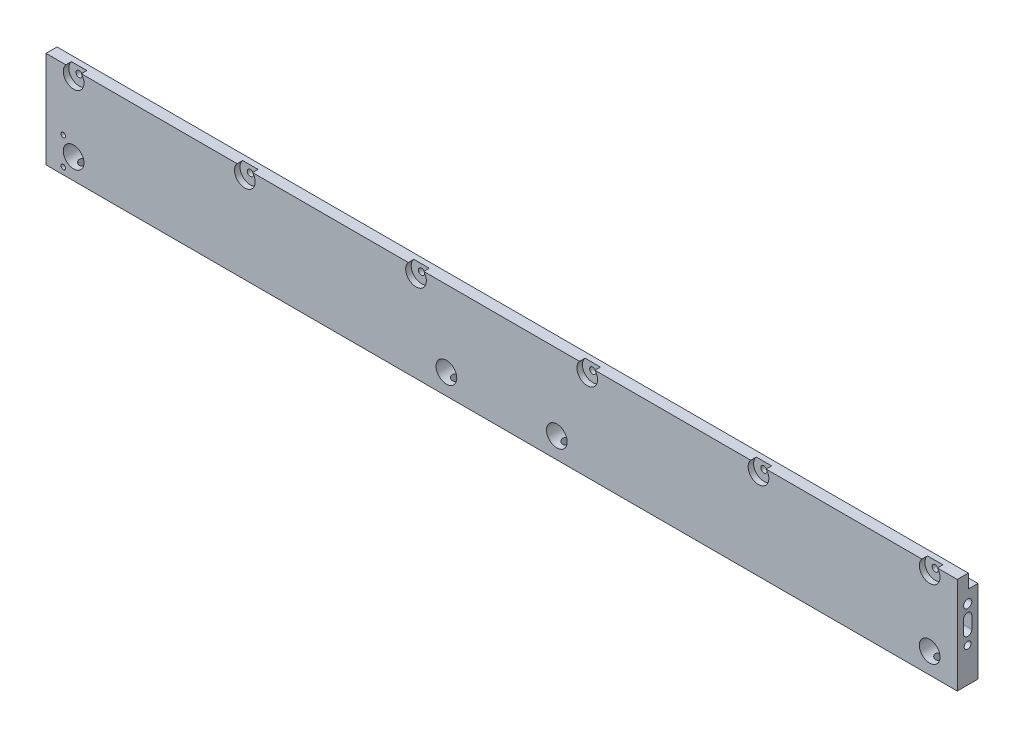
ISO-10303-21;
HEADER;
FILE_DESCRIPTION(('STEP AP214'),'2;1');
FILE_NAME('part.step','',(''),(''),'','','');
FILE_SCHEMA(('AUTOMOTIVE_DESIGN { 1 0 10303 214 1 1 1 1 }'));
ENDSEC;
DATA;
#1=APPLICATION_CONTEXT('core data for automotive mechanical design processes');
#2=APPLICATION_PROTOCOL_DEFINITION('international standard','automotive_design',2000,#1);
#3=PRODUCT_CONTEXT('',#1,'mechanical');
#4=PRODUCT('Part','Part','',(#3));
#5=PRODUCT_RELATED_PRODUCT_CATEGORY('part','',(#4));
#6=PRODUCT_DEFINITION_FORMATION('','',#4);
#7=PRODUCT_DEFINITION_CONTEXT('part definition',#1,'design');
#8=PRODUCT_DEFINITION('design','',#6,#7);
#9=PRODUCT_DEFINITION_SHAPE('','',#8);
#10=(LENGTH_UNIT() NAMED_UNIT(*) SI_UNIT(.MILLI.,.METRE.));
#11=(NAMED_UNIT(*) PLANE_ANGLE_UNIT() SI_UNIT($,.RADIAN.));
#12=(NAMED_UNIT(*) SI_UNIT($,.STERADIAN.) SOLID_ANGLE_UNIT());
#13=UNCERTAINTY_MEASURE_WITH_UNIT(LENGTH_MEASURE(1.E-05),#10,'distance_accuracy_value','');
#14=(GEOMETRIC_REPRESENTATION_CONTEXT(3) GLOBAL_UNCERTAINTY_ASSIGNED_CONTEXT((#13)) GLOBAL_UNIT_ASSIGNED_CONTEXT((#10,
#11,#12)) REPRESENTATION_CONTEXT('',''));
#15=CARTESIAN_POINT('',(0.,0.,0.));
#16=DIRECTION('',(0.,0.,1.));
#17=DIRECTION('',(1.,0.,0.));
#18=AXIS2_PLACEMENT_3D('',#15,#16,#17);
#19=CARTESIAN_POINT('',(330.,0.,-15.));
#20=DIRECTION('',(0.,1.,0.));
#21=DIRECTION('',(0.,0.,1.));
#22=AXIS2_PLACEMENT_3D('',#19,#20,#21);
#23=PLANE('',#22);
#24=CARTESIAN_POINT('',(40.,0.,-7.5));
#25=DIRECTION('',(0.,-1.,0.));
#26=DIRECTION('',(0.,0.,-1.));
#27=AXIS2_PLACEMENT_3D('',#24,#25,#26);
#28=CIRCLE('',#27,3.24999999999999);
#29=CARTESIAN_POINT('',(40.,0.,-10.75));
#30=VERTEX_POINT('',#29);
#31=EDGE_CURVE('E377',#30,#30,#28,.T.);
#32=ORIENTED_EDGE('',*,*,#31,.F.);
#33=EDGE_LOOP('',(#32));
#34=FACE_BOUND('',#33,.T.);
#35=CARTESIAN_POINT('',(-310.,0.,-7.5));
#36=DIRECTION('',(0.,-1.,0.));
#37=DIRECTION('',(0.,0.,-1.));
#38=AXIS2_PLACEMENT_3D('',#35,#36,#37);
#39=CIRCLE('',#38,3.24999999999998);
#40=CARTESIAN_POINT('',(-310.,0.,-10.75));
#41=VERTEX_POINT('',#40);
#42=EDGE_CURVE('E519',#41,#41,#39,.T.);
#43=ORIENTED_EDGE('',*,*,#42,.F.);
#44=EDGE_LOOP('',(#43));
#45=FACE_BOUND('',#44,.T.);
#46=DIRECTION('',(0.,0.,-1.));
#47=VECTOR('',#46,1.);
#48=CARTESIAN_POINT('',(-330.,0.,-15.));
#49=LINE('',#48,#47);
#50=CARTESIAN_POINT('',(-330.,0.,0.));
#51=VERTEX_POINT('',#50);
#52=CARTESIAN_POINT('',(-330.,0.,-15.));
#53=VERTEX_POINT('',#52);
#54=EDGE_CURVE('E525',#51,#53,#49,.T.);
#55=ORIENTED_EDGE('',*,*,#54,.T.);
#56=DIRECTION('',(-1.,0.,0.));
#57=VECTOR('',#56,1.);
#58=CARTESIAN_POINT('',(330.,0.,-15.));
#59=LINE('',#58,#57);
#60=CARTESIAN_POINT('',(330.,0.,-15.));
#61=VERTEX_POINT('',#60);
#62=EDGE_CURVE('E620',#61,#53,#59,.T.);
#63=ORIENTED_EDGE('',*,*,#62,.F.);
#64=DIRECTION('',(0.,0.,-1.));
#65=VECTOR('',#64,1.);
#66=CARTESIAN_POINT('',(330.,0.,-15.));
#67=LINE('',#66,#65);
#68=CARTESIAN_POINT('',(330.,0.,0.));
#69=VERTEX_POINT('',#68);
#70=EDGE_CURVE('E580',#69,#61,#67,.T.);
#71=ORIENTED_EDGE('',*,*,#70,.F.);
#72=DIRECTION('',(-1.,0.,0.));
#73=VECTOR('',#72,1.);
#74=CARTESIAN_POINT('',(330.,0.,0.));
#75=LINE('',#74,#73);
#76=EDGE_CURVE('E648',#69,#51,#75,.T.);
#77=ORIENTED_EDGE('',*,*,#76,.T.);
#78=EDGE_LOOP('',(#55,#63,#71,#77));
#79=FACE_BOUND('',#78,.T.);
#80=CARTESIAN_POINT('',(-40.,0.,-7.5));
#81=DIRECTION('',(0.,-1.,0.));
#82=DIRECTION('',(0.,0.,-1.));
#83=AXIS2_PLACEMENT_3D('',#80,#81,#82);
#84=CIRCLE('',#83,3.24999999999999);
#85=CARTESIAN_POINT('',(-40.,0.,-10.75));
#86=VERTEX_POINT('',#85);
#87=EDGE_CURVE('E529',#86,#86,#84,.T.);
#88=ORIENTED_EDGE('',*,*,#87,.F.);
#89=EDGE_LOOP('',(#88));
#90=FACE_BOUND('',#89,.T.);
#91=CARTESIAN_POINT('',(310.,0.,-7.5));
#92=DIRECTION('',(0.,-1.,0.));
#93=DIRECTION('',(0.,0.,-1.));
#94=AXIS2_PLACEMENT_3D('',#91,#92,#93);
#95=CIRCLE('',#94,3.24999999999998);
#96=CARTESIAN_POINT('',(310.,0.,-10.75));
#97=VERTEX_POINT('',#96);
#98=EDGE_CURVE('E365',#97,#97,#95,.T.);
#99=ORIENTED_EDGE('',*,*,#98,.F.);
#100=EDGE_LOOP('',(#99));
#101=FACE_BOUND('',#100,.T.);
#102=ADVANCED_FACE('F42',(#34,#45,#79,#90,#101),#23,.F.);
#103=CARTESIAN_POINT('',(330.,60.,-15.));
#104=DIRECTION('',(0.,0.,1.));
#105=DIRECTION('',(0.,-1.,0.));
#106=AXIS2_PLACEMENT_3D('',#103,#104,#105);
#107=PLANE('',#106);
#108=CARTESIAN_POINT('',(-317.5,25.,-15.));
#109=DIRECTION('',(0.,0.,-1.));
#110=DIRECTION('',(0.,1.,0.));
#111=AXIS2_PLACEMENT_3D('',#108,#109,#110);
#112=CIRCLE('',#111,1.64999999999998);
#113=CARTESIAN_POINT('',(-317.5,26.65,-15.));
#114=VERTEX_POINT('',#113);
#115=EDGE_CURVE('E345',#114,#114,#112,.T.);
#116=ORIENTED_EDGE('',*,*,#115,.F.);
#117=EDGE_LOOP('',(#116));
#118=FACE_BOUND('',#117,.T.);
#119=CARTESIAN_POINT('',(-317.5,5.,-15.));
#120=DIRECTION('',(0.,0.,-1.));
#121=DIRECTION('',(0.,1.,0.));
#122=AXIS2_PLACEMENT_3D('',#119,#120,#121);
#123=CIRCLE('',#122,1.64999999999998);
#124=CARTESIAN_POINT('',(-317.5,6.64999999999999,-15.));
#125=VERTEX_POINT('',#124);
#126=EDGE_CURVE('E353',#125,#125,#123,.T.);
#127=ORIENTED_EDGE('',*,*,#126,.F.);
#128=EDGE_LOOP('',(#127));
#129=FACE_BOUND('',#128,.T.);
#130=CARTESIAN_POINT('',(310.,15.,-15.));
#131=DIRECTION('',(0.,0.,-1.));
#132=DIRECTION('',(0.,1.,0.));
#133=AXIS2_PLACEMENT_3D('',#130,#131,#132);
#134=CIRCLE('',#133,7.50000000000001);
#135=CARTESIAN_POINT('',(310.,22.5,-15.));
#136=VERTEX_POINT('',#135);
#137=EDGE_CURVE('E588',#136,#136,#134,.T.);
#138=ORIENTED_EDGE('',*,*,#137,.F.);
#139=EDGE_LOOP('',(#138));
#140=FACE_BOUND('',#139,.T.);
#141=CARTESIAN_POINT('',(40.,15.,-15.));
#142=DIRECTION('',(0.,0.,-1.));
#143=DIRECTION('',(0.,1.,0.));
#144=AXIS2_PLACEMENT_3D('',#141,#142,#143);
#145=CIRCLE('',#144,7.49999999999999);
#146=CARTESIAN_POINT('',(40.,22.5,-15.));
#147=VERTEX_POINT('',#146);
#148=EDGE_CURVE('E764',#147,#147,#145,.T.);
#149=ORIENTED_EDGE('',*,*,#148,.F.);
#150=EDGE_LOOP('',(#149));
#151=FACE_BOUND('',#150,.T.);
#152=CARTESIAN_POINT('',(-40.,15.,-15.));
#153=DIRECTION('',(0.,0.,-1.));
#154=DIRECTION('',(0.,1.,0.));
#155=AXIS2_PLACEMENT_3D('',#152,#153,#154);
#156=CIRCLE('',#155,7.49999999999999);
#157=CARTESIAN_POINT('',(-40.,22.5,-15.));
#158=VERTEX_POINT('',#157);
#159=EDGE_CURVE('E594',#158,#158,#156,.T.);
#160=ORIENTED_EDGE('',*,*,#159,.F.);
#161=EDGE_LOOP('',(#160));
#162=FACE_BOUND('',#161,.T.);
#163=CARTESIAN_POINT('',(-310.,15.,-15.));
#164=DIRECTION('',(0.,0.,-1.));
#165=DIRECTION('',(0.,1.,0.));
#166=AXIS2_PLACEMENT_3D('',#163,#164,#165);
#167=CIRCLE('',#166,7.50000000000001);
#168=CARTESIAN_POINT('',(-310.,22.5,-15.));
#169=VERTEX_POINT('',#168);
#170=EDGE_CURVE('E663',#169,#169,#167,.T.);
#171=ORIENTED_EDGE('',*,*,#170,.F.);
#172=EDGE_LOOP('',(#171));
#173=FACE_BOUND('',#172,.T.);
#174=DIRECTION('',(0.,1.,0.));
#175=VECTOR('',#174,1.);
#176=CARTESIAN_POINT('',(-330.,60.,-15.));
#177=LINE('',#176,#175);
#178=CARTESIAN_POINT('',(-330.,60.,-15.));
#179=VERTEX_POINT('',#178);
#180=EDGE_CURVE('E617',#53,#179,#177,.T.);
#181=ORIENTED_EDGE('',*,*,#180,.T.);
#182=DIRECTION('',(-1.,0.,0.));
#183=VECTOR('',#182,1.);
#184=CARTESIAN_POINT('',(330.,60.,-15.));
#185=LINE('',#184,#183);
#186=CARTESIAN_POINT('',(330.,60.,-15.));
#187=VERTEX_POINT('',#186);
#188=EDGE_CURVE('E624',#187,#179,#185,.T.);
#189=ORIENTED_EDGE('',*,*,#188,.F.);
#190=DIRECTION('',(0.,1.,0.));
#191=VECTOR('',#190,1.);
#192=CARTESIAN_POINT('',(330.,60.,-15.));
#193=LINE('',#192,#191);
#194=EDGE_CURVE('E586',#61,#187,#193,.T.);
#195=ORIENTED_EDGE('',*,*,#194,.F.);
#196=ORIENTED_EDGE('',*,*,#62,.T.);
#197=EDGE_LOOP('',(#181,#189,#195,#196));
#198=FACE_BOUND('',#197,.T.);
#199=ADVANCED_FACE('F506',(#118,#129,#140,#151,#162,#173,#198),#107,.F.);
#200=CARTESIAN_POINT('',(330.,60.,-8.));
#201=DIRECTION('',(0.,-1.,0.));
#202=DIRECTION('',(0.,0.,-1.));
#203=AXIS2_PLACEMENT_3D('',#200,#201,#202);
#204=PLANE('',#203);
#205=DIRECTION('',(0.,0.,1.));
#206=VECTOR('',#205,1.);
#207=CARTESIAN_POINT('',(-330.,60.,-8.));
#208=LINE('',#207,#206);
#209=CARTESIAN_POINT('',(-330.,60.,-8.));
#210=VERTEX_POINT('',#209);
#211=EDGE_CURVE('E725',#179,#210,#208,.T.);
#212=ORIENTED_EDGE('',*,*,#211,.T.);
#213=DIRECTION('',(-1.,0.,0.));
#214=VECTOR('',#213,1.);
#215=CARTESIAN_POINT('',(330.,60.,-8.));
#216=LINE('',#215,#214);
#217=CARTESIAN_POINT('',(330.,60.,-8.));
#218=VERTEX_POINT('',#217);
#219=EDGE_CURVE('E613',#218,#210,#216,.T.);
#220=ORIENTED_EDGE('',*,*,#219,.F.);
#221=DIRECTION('',(0.,0.,1.));
#222=VECTOR('',#221,1.);
#223=CARTESIAN_POINT('',(330.,60.,-8.));
#224=LINE('',#223,#222);
#225=EDGE_CURVE('E608',#187,#218,#224,.T.);
#226=ORIENTED_EDGE('',*,*,#225,.F.);
#227=ORIENTED_EDGE('',*,*,#188,.T.);
#228=EDGE_LOOP('',(#212,#220,#226,#227));
#229=FACE_BOUND('',#228,.T.);
#230=ADVANCED_FACE('F511',(#229),#204,.F.);
#231=CARTESIAN_POINT('',(330.,70.,-8.));
#232=DIRECTION('',(0.,0.,1.));
#233=DIRECTION('',(0.,-1.,0.));
#234=AXIS2_PLACEMENT_3D('',#231,#232,#233);
#235=PLANE('',#234);
#236=CARTESIAN_POINT('',(186.,65.,-8.));
#237=DIRECTION('',(0.,0.,1.));
#238=DIRECTION('',(0.,-1.,0.));
#239=AXIS2_PLACEMENT_3D('',#236,#237,#238);
#240=CIRCLE('',#239,2.25);
#241=CARTESIAN_POINT('',(186.,62.75,-8.));
#242=VERTEX_POINT('',#241);
#243=EDGE_CURVE('E45',#242,#242,#240,.T.);
#244=ORIENTED_EDGE('',*,*,#243,.T.);
#245=EDGE_LOOP('',(#244));
#246=FACE_BOUND('',#245,.T.);
#247=CARTESIAN_POINT('',(310.,65.,-8.));
#248=DIRECTION('',(0.,0.,1.));
#249=DIRECTION('',(0.,-1.,0.));
#250=AXIS2_PLACEMENT_3D('',#247,#248,#249);
#251=CIRCLE('',#250,2.24999999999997);
#252=CARTESIAN_POINT('',(310.,62.75,-8.));
#253=VERTEX_POINT('',#252);
#254=EDGE_CURVE('E293',#253,#253,#251,.T.);
#255=ORIENTED_EDGE('',*,*,#254,.T.);
#256=EDGE_LOOP('',(#255));
#257=FACE_BOUND('',#256,.T.);
#258=CARTESIAN_POINT('',(62.,65.,-8.));
#259=DIRECTION('',(0.,0.,1.));
#260=DIRECTION('',(0.,-1.,0.));
#261=AXIS2_PLACEMENT_3D('',#258,#259,#260);
#262=CIRCLE('',#261,2.25);
#263=CARTESIAN_POINT('',(62.,62.75,-8.));
#264=VERTEX_POINT('',#263);
#265=EDGE_CURVE('E305',#264,#264,#262,.T.);
#266=ORIENTED_EDGE('',*,*,#265,.T.);
#267=EDGE_LOOP('',(#266));
#268=FACE_BOUND('',#267,.T.);
#269=CARTESIAN_POINT('',(-62.,65.,-8.));
#270=DIRECTION('',(0.,0.,1.));
#271=DIRECTION('',(0.,-1.,0.));
#272=AXIS2_PLACEMENT_3D('',#269,#270,#271);
#273=CIRCLE('',#272,2.25);
#274=CARTESIAN_POINT('',(-62.,62.75,-8.));
#275=VERTEX_POINT('',#274);
#276=EDGE_CURVE('E316',#275,#275,#273,.T.);
#277=ORIENTED_EDGE('',*,*,#276,.T.);
#278=EDGE_LOOP('',(#277));
#279=FACE_BOUND('',#278,.T.);
#280=CARTESIAN_POINT('',(-186.,65.,-8.));
#281=DIRECTION('',(0.,0.,1.));
#282=DIRECTION('',(0.,-1.,0.));
#283=AXIS2_PLACEMENT_3D('',#280,#281,#282);
#284=CIRCLE('',#283,2.25);
#285=CARTESIAN_POINT('',(-186.,62.75,-8.));
#286=VERTEX_POINT('',#285);
#287=EDGE_CURVE('E328',#286,#286,#284,.T.);
#288=ORIENTED_EDGE('',*,*,#287,.T.);
#289=EDGE_LOOP('',(#288));
#290=FACE_BOUND('',#289,.T.);
#291=CARTESIAN_POINT('',(-310.,65.,-8.));
#292=DIRECTION('',(0.,0.,1.));
#293=DIRECTION('',(0.,-1.,0.));
#294=AXIS2_PLACEMENT_3D('',#291,#292,#293);
#295=CIRCLE('',#294,2.24999999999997);
#296=CARTESIAN_POINT('',(-310.,62.75,-8.));
#297=VERTEX_POINT('',#296);
#298=EDGE_CURVE('E340',#297,#297,#295,.T.);
#299=ORIENTED_EDGE('',*,*,#298,.T.);
#300=EDGE_LOOP('',(#299));
#301=FACE_BOUND('',#300,.T.);
#302=DIRECTION('',(0.,1.,0.));
#303=VECTOR('',#302,1.);
#304=CARTESIAN_POINT('',(-330.,70.,-8.));
#305=LINE('',#304,#303);
#306=CARTESIAN_POINT('',(-330.,70.,-8.));
#307=VERTEX_POINT('',#306);
#308=EDGE_CURVE('E733',#210,#307,#305,.T.);
#309=ORIENTED_EDGE('',*,*,#308,.T.);
#310=DIRECTION('',(-1.,0.,0.));
#311=VECTOR('',#310,1.);
#312=CARTESIAN_POINT('',(330.,70.,-8.));
#313=LINE('',#312,#311);
#314=CARTESIAN_POINT('',(330.,70.,-8.));
#315=VERTEX_POINT('',#314);
#316=EDGE_CURVE('E571',#315,#307,#313,.T.);
#317=ORIENTED_EDGE('',*,*,#316,.F.);
#318=DIRECTION('',(0.,1.,0.));
#319=VECTOR('',#318,1.);
#320=CARTESIAN_POINT('',(330.,70.,-8.));
#321=LINE('',#320,#319);
#322=EDGE_CURVE('E610',#218,#315,#321,.T.);
#323=ORIENTED_EDGE('',*,*,#322,.F.);
#324=ORIENTED_EDGE('',*,*,#219,.T.);
#325=EDGE_LOOP('',(#309,#317,#323,#324));
#326=FACE_BOUND('',#325,.T.);
#327=ADVANCED_FACE('F714',(#246,#257,#268,#279,#290,#301,#326),#235,.F.);
#328=CARTESIAN_POINT('',(330.,70.,0.));
#329=DIRECTION('',(0.,-1.,0.));
#330=DIRECTION('',(0.,0.,-1.));
#331=AXIS2_PLACEMENT_3D('',#328,#329,#330);
#332=PLANE('',#331);
#333=DIRECTION('',(1.,0.,0.));
#334=VECTOR('',#333,1.);
#335=CARTESIAN_POINT('',(330.,70.,-4.));
#336=LINE('',#335,#334);
#337=CARTESIAN_POINT('',(180.409830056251,70.,-4.));
#338=VERTEX_POINT('',#337);
#339=CARTESIAN_POINT('',(191.590169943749,70.,-4.));
#340=VERTEX_POINT('',#339);
#341=EDGE_CURVE('E603',#338,#340,#336,.T.);
#342=ORIENTED_EDGE('',*,*,#341,.T.);
#343=DIRECTION('',(0.,0.,1.));
#344=VECTOR('',#343,1.);
#345=CARTESIAN_POINT('',(191.590169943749,70.,0.));
#346=LINE('',#345,#344);
#347=CARTESIAN_POINT('',(191.590169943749,70.,0.));
#348=VERTEX_POINT('',#347);
#349=EDGE_CURVE('E11',#340,#348,#346,.T.);
#350=ORIENTED_EDGE('',*,*,#349,.T.);
#351=DIRECTION('',(-1.,0.,0.));
#352=VECTOR('',#351,1.);
#353=CARTESIAN_POINT('',(330.,70.,0.));
#354=LINE('',#353,#352);
#355=CARTESIAN_POINT('',(304.40983005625,70.,0.));
#356=VERTEX_POINT('',#355);
#357=EDGE_CURVE('E572',#356,#348,#354,.T.);
#358=ORIENTED_EDGE('',*,*,#357,.F.);
#359=DIRECTION('',(0.,0.,1.));
#360=VECTOR('',#359,1.);
#361=CARTESIAN_POINT('',(304.40983005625,70.,0.));
#362=LINE('',#361,#360);
#363=CARTESIAN_POINT('',(304.40983005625,70.,-4.));
#364=VERTEX_POINT('',#363);
#365=EDGE_CURVE('E629',#356,#364,#362,.F.);
#366=ORIENTED_EDGE('',*,*,#365,.T.);
#367=DIRECTION('',(1.,0.,0.));
#368=VECTOR('',#367,1.);
#369=CARTESIAN_POINT('',(330.,70.,-4.));
#370=LINE('',#369,#368);
#371=CARTESIAN_POINT('',(315.59016994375,70.,-4.));
#372=VERTEX_POINT('',#371);
#373=EDGE_CURVE('E632',#364,#372,#370,.T.);
#374=ORIENTED_EDGE('',*,*,#373,.T.);
#375=DIRECTION('',(0.,0.,1.));
#376=VECTOR('',#375,1.);
#377=CARTESIAN_POINT('',(315.59016994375,70.,0.));
#378=LINE('',#377,#376);
#379=CARTESIAN_POINT('',(315.59016994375,70.,0.));
#380=VERTEX_POINT('',#379);
#381=EDGE_CURVE('E605',#372,#380,#378,.T.);
#382=ORIENTED_EDGE('',*,*,#381,.T.);
#383=CARTESIAN_POINT('',(330.,70.,0.));
#384=VERTEX_POINT('',#383);
#385=EDGE_CURVE('E568',#384,#380,#354,.T.);
#386=ORIENTED_EDGE('',*,*,#385,.F.);
#387=DIRECTION('',(0.,0.,1.));
#388=VECTOR('',#387,1.);
#389=CARTESIAN_POINT('',(330.,70.,0.));
#390=LINE('',#389,#388);
#391=EDGE_CURVE('E750',#315,#384,#390,.T.);
#392=ORIENTED_EDGE('',*,*,#391,.F.);
#393=ORIENTED_EDGE('',*,*,#316,.T.);
#394=DIRECTION('',(0.,0.,1.));
#395=VECTOR('',#394,1.);
#396=CARTESIAN_POINT('',(-330.,70.,0.));
#397=LINE('',#396,#395);
#398=CARTESIAN_POINT('',(-330.,70.,0.));
#399=VERTEX_POINT('',#398);
#400=EDGE_CURVE('E581',#307,#399,#397,.T.);
#401=ORIENTED_EDGE('',*,*,#400,.T.);
#402=CARTESIAN_POINT('',(-315.59016994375,70.,0.));
#403=VERTEX_POINT('',#402);
#404=EDGE_CURVE('E575',#403,#399,#354,.T.);
#405=ORIENTED_EDGE('',*,*,#404,.F.);
#406=DIRECTION('',(0.,0.,1.));
#407=VECTOR('',#406,1.);
#408=CARTESIAN_POINT('',(-315.59016994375,70.,0.));
#409=LINE('',#408,#407);
#410=CARTESIAN_POINT('',(-315.59016994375,70.,-4.));
#411=VERTEX_POINT('',#410);
#412=EDGE_CURVE('E638',#403,#411,#409,.F.);
#413=ORIENTED_EDGE('',*,*,#412,.T.);
#414=DIRECTION('',(1.,0.,0.));
#415=VECTOR('',#414,1.);
#416=CARTESIAN_POINT('',(330.,70.,-4.));
#417=LINE('',#416,#415);
#418=CARTESIAN_POINT('',(-304.40983005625,70.,-4.));
#419=VERTEX_POINT('',#418);
#420=EDGE_CURVE('E623',#411,#419,#417,.T.);
#421=ORIENTED_EDGE('',*,*,#420,.T.);
#422=DIRECTION('',(0.,0.,1.));
#423=VECTOR('',#422,1.);
#424=CARTESIAN_POINT('',(-304.40983005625,70.,0.));
#425=LINE('',#424,#423);
#426=CARTESIAN_POINT('',(-304.40983005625,70.,0.));
#427=VERTEX_POINT('',#426);
#428=EDGE_CURVE('E634',#419,#427,#425,.T.);
#429=ORIENTED_EDGE('',*,*,#428,.T.);
#430=CARTESIAN_POINT('',(-191.590169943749,70.,0.));
#431=VERTEX_POINT('',#430);
#432=EDGE_CURVE('E647',#431,#427,#354,.T.);
#433=ORIENTED_EDGE('',*,*,#432,.F.);
#434=DIRECTION('',(0.,0.,1.));
#435=VECTOR('',#434,1.);
#436=CARTESIAN_POINT('',(-191.590169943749,70.,0.));
#437=LINE('',#436,#435);
#438=CARTESIAN_POINT('',(-191.590169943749,70.,-4.));
#439=VERTEX_POINT('',#438);
#440=EDGE_CURVE('E780',#431,#439,#437,.F.);
#441=ORIENTED_EDGE('',*,*,#440,.T.);
#442=DIRECTION('',(1.,0.,0.));
#443=VECTOR('',#442,1.);
#444=CARTESIAN_POINT('',(330.,70.,-4.));
#445=LINE('',#444,#443);
#446=CARTESIAN_POINT('',(-180.409830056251,70.,-4.));
#447=VERTEX_POINT('',#446);
#448=EDGE_CURVE('E637',#439,#447,#445,.T.);
#449=ORIENTED_EDGE('',*,*,#448,.T.);
#450=DIRECTION('',(0.,0.,1.));
#451=VECTOR('',#450,1.);
#452=CARTESIAN_POINT('',(-180.409830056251,70.,0.));
#453=LINE('',#452,#451);
#454=CARTESIAN_POINT('',(-180.409830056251,70.,0.));
#455=VERTEX_POINT('',#454);
#456=EDGE_CURVE('E654',#447,#455,#453,.T.);
#457=ORIENTED_EDGE('',*,*,#456,.T.);
#458=CARTESIAN_POINT('',(-67.5901699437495,70.,0.));
#459=VERTEX_POINT('',#458);
#460=EDGE_CURVE('E578',#459,#455,#354,.T.);
#461=ORIENTED_EDGE('',*,*,#460,.F.);
#462=DIRECTION('',(0.,0.,1.));
#463=VECTOR('',#462,1.);
#464=CARTESIAN_POINT('',(-67.5901699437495,70.,0.));
#465=LINE('',#464,#463);
#466=CARTESIAN_POINT('',(-67.5901699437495,70.,-4.));
#467=VERTEX_POINT('',#466);
#468=EDGE_CURVE('E653',#459,#467,#465,.F.);
#469=ORIENTED_EDGE('',*,*,#468,.T.);
#470=DIRECTION('',(1.,0.,0.));
#471=VECTOR('',#470,1.);
#472=CARTESIAN_POINT('',(330.,70.,-4.));
#473=LINE('',#472,#471);
#474=CARTESIAN_POINT('',(-56.4098300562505,70.,-4.));
#475=VERTEX_POINT('',#474);
#476=EDGE_CURVE('E650',#467,#475,#473,.T.);
#477=ORIENTED_EDGE('',*,*,#476,.T.);
#478=DIRECTION('',(0.,0.,1.));
#479=VECTOR('',#478,1.);
#480=CARTESIAN_POINT('',(-56.4098300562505,70.,0.));
#481=LINE('',#480,#479);
#482=CARTESIAN_POINT('',(-56.4098300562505,70.,0.));
#483=VERTEX_POINT('',#482);
#484=EDGE_CURVE('E659',#475,#483,#481,.T.);
#485=ORIENTED_EDGE('',*,*,#484,.T.);
#486=CARTESIAN_POINT('',(56.4098300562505,70.,0.));
#487=VERTEX_POINT('',#486);
#488=EDGE_CURVE('E576',#487,#483,#354,.T.);
#489=ORIENTED_EDGE('',*,*,#488,.F.);
#490=DIRECTION('',(0.,0.,1.));
#491=VECTOR('',#490,1.);
#492=CARTESIAN_POINT('',(56.4098300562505,70.,0.));
#493=LINE('',#492,#491);
#494=CARTESIAN_POINT('',(56.4098300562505,70.,-4.));
#495=VERTEX_POINT('',#494);
#496=EDGE_CURVE('E642',#487,#495,#493,.F.);
#497=ORIENTED_EDGE('',*,*,#496,.T.);
#498=DIRECTION('',(1.,0.,0.));
#499=VECTOR('',#498,1.);
#500=CARTESIAN_POINT('',(330.,70.,-4.));
#501=LINE('',#500,#499);
#502=CARTESIAN_POINT('',(67.5901699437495,70.,-4.));
#503=VERTEX_POINT('',#502);
#504=EDGE_CURVE('E656',#495,#503,#501,.T.);
#505=ORIENTED_EDGE('',*,*,#504,.T.);
#506=DIRECTION('',(0.,0.,1.));
#507=VECTOR('',#506,1.);
#508=CARTESIAN_POINT('',(67.5901699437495,70.,0.));
#509=LINE('',#508,#507);
#510=CARTESIAN_POINT('',(67.5901699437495,70.,0.));
#511=VERTEX_POINT('',#510);
#512=EDGE_CURVE('E640',#503,#511,#509,.T.);
#513=ORIENTED_EDGE('',*,*,#512,.T.);
#514=CARTESIAN_POINT('',(180.409830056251,70.,0.));
#515=VERTEX_POINT('',#514);
#516=EDGE_CURVE('E574',#515,#511,#354,.T.);
#517=ORIENTED_EDGE('',*,*,#516,.F.);
#518=DIRECTION('',(0.,0.,1.));
#519=VECTOR('',#518,1.);
#520=CARTESIAN_POINT('',(180.409830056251,70.,0.));
#521=LINE('',#520,#519);
#522=EDGE_CURVE('E51',#515,#338,#521,.F.);
#523=ORIENTED_EDGE('',*,*,#522,.T.);
#524=EDGE_LOOP('',(#342,#350,#358,#366,#374,#382,#386,#392,#393,#401,#405,#413,#421,#429,#433,
#441,#449,#457,#461,#469,#477,#485,#489,#497,#505,#513,#517,#523));
#525=FACE_BOUND('',#524,.T.);
#526=ADVANCED_FACE('F710',(#525),#332,.F.);
#527=CARTESIAN_POINT('',(330.,0.,0.));
#528=DIRECTION('',(0.,0.,-1.));
#529=DIRECTION('',(-1.,0.,0.));
#530=AXIS2_PLACEMENT_3D('',#527,#528,#529);
#531=PLANE('',#530);
#532=CARTESIAN_POINT('',(-317.5,25.,0.));
#533=DIRECTION('',(0.,0.,-1.));
#534=DIRECTION('',(0.,1.,0.));
#535=AXIS2_PLACEMENT_3D('',#532,#533,#534);
#536=CIRCLE('',#535,1.64999999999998);
#537=CARTESIAN_POINT('',(-317.5,26.65,0.));
#538=VERTEX_POINT('',#537);
#539=EDGE_CURVE('E341',#538,#538,#536,.T.);
#540=ORIENTED_EDGE('',*,*,#539,.T.);
#541=EDGE_LOOP('',(#540));
#542=FACE_BOUND('',#541,.T.);
#543=CARTESIAN_POINT('',(-317.5,5.,0.));
#544=DIRECTION('',(0.,0.,-1.));
#545=DIRECTION('',(0.,1.,0.));
#546=AXIS2_PLACEMENT_3D('',#543,#544,#545);
#547=CIRCLE('',#546,1.64999999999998);
#548=CARTESIAN_POINT('',(-317.5,6.64999999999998,0.));
#549=VERTEX_POINT('',#548);
#550=EDGE_CURVE('E349',#549,#549,#547,.T.);
#551=ORIENTED_EDGE('',*,*,#550,.T.);
#552=EDGE_LOOP('',(#551));
#553=FACE_BOUND('',#552,.T.);
#554=CARTESIAN_POINT('',(310.,15.,0.));
#555=DIRECTION('',(0.,0.,-1.));
#556=DIRECTION('',(-1.,0.,0.));
#557=AXIS2_PLACEMENT_3D('',#554,#555,#556);
#558=CIRCLE('',#557,7.50000000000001);
#559=CARTESIAN_POINT('',(302.5,15.,0.));
#560=VERTEX_POINT('',#559);
#561=EDGE_CURVE('E591',#560,#560,#558,.T.);
#562=ORIENTED_EDGE('',*,*,#561,.T.);
#563=EDGE_LOOP('',(#562));
#564=FACE_BOUND('',#563,.T.);
#565=CARTESIAN_POINT('',(40.,15.,0.));
#566=DIRECTION('',(0.,0.,-1.));
#567=DIRECTION('',(-1.,0.,0.));
#568=AXIS2_PLACEMENT_3D('',#565,#566,#567);
#569=CIRCLE('',#568,7.49999999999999);
#570=CARTESIAN_POINT('',(32.5,15.,0.));
#571=VERTEX_POINT('',#570);
#572=EDGE_CURVE('E598',#571,#571,#569,.T.);
#573=ORIENTED_EDGE('',*,*,#572,.T.);
#574=EDGE_LOOP('',(#573));
#575=FACE_BOUND('',#574,.T.);
#576=CARTESIAN_POINT('',(-40.,15.,0.));
#577=DIRECTION('',(0.,0.,-1.));
#578=DIRECTION('',(-1.,0.,0.));
#579=AXIS2_PLACEMENT_3D('',#576,#577,#578);
#580=CIRCLE('',#579,7.49999999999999);
#581=CARTESIAN_POINT('',(-47.5,15.,0.));
#582=VERTEX_POINT('',#581);
#583=EDGE_CURVE('E597',#582,#582,#580,.T.);
#584=ORIENTED_EDGE('',*,*,#583,.T.);
#585=EDGE_LOOP('',(#584));
#586=FACE_BOUND('',#585,.T.);
#587=CARTESIAN_POINT('',(-310.,15.,0.));
#588=DIRECTION('',(0.,0.,-1.));
#589=DIRECTION('',(-1.,0.,0.));
#590=AXIS2_PLACEMENT_3D('',#587,#588,#589);
#591=CIRCLE('',#590,7.50000000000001);
#592=CARTESIAN_POINT('',(-317.5,15.,0.));
#593=VERTEX_POINT('',#592);
#594=EDGE_CURVE('E618',#593,#593,#591,.T.);
#595=ORIENTED_EDGE('',*,*,#594,.T.);
#596=EDGE_LOOP('',(#595));
#597=FACE_BOUND('',#596,.T.);
#598=ORIENTED_EDGE('',*,*,#357,.T.);
#599=CARTESIAN_POINT('',(186.,65.,0.));
#600=DIRECTION('',(0.,0.,1.));
#601=DIRECTION('',(1.,0.,0.));
#602=AXIS2_PLACEMENT_3D('',#599,#600,#601);
#603=CIRCLE('',#602,7.50000000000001);
#604=EDGE_CURVE('E280',#515,#348,#603,.T.);
#605=ORIENTED_EDGE('',*,*,#604,.F.);
#606=ORIENTED_EDGE('',*,*,#516,.T.);
#607=CARTESIAN_POINT('',(62.,65.,0.));
#608=DIRECTION('',(0.,0.,1.));
#609=DIRECTION('',(1.,0.,0.));
#610=AXIS2_PLACEMENT_3D('',#607,#608,#609);
#611=CIRCLE('',#610,7.49999999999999);
#612=EDGE_CURVE('E301',#487,#511,#611,.T.);
#613=ORIENTED_EDGE('',*,*,#612,.F.);
#614=ORIENTED_EDGE('',*,*,#488,.T.);
#615=CARTESIAN_POINT('',(-62.,65.,0.));
#616=DIRECTION('',(0.,0.,1.));
#617=DIRECTION('',(1.,0.,0.));
#618=AXIS2_PLACEMENT_3D('',#615,#616,#617);
#619=CIRCLE('',#618,7.5);
#620=EDGE_CURVE('E312',#459,#483,#619,.T.);
#621=ORIENTED_EDGE('',*,*,#620,.F.);
#622=ORIENTED_EDGE('',*,*,#460,.T.);
#623=CARTESIAN_POINT('',(-186.,65.,0.));
#624=DIRECTION('',(0.,0.,1.));
#625=DIRECTION('',(1.,0.,0.));
#626=AXIS2_PLACEMENT_3D('',#623,#624,#625);
#627=CIRCLE('',#626,7.50000000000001);
#628=EDGE_CURVE('E324',#431,#455,#627,.T.);
#629=ORIENTED_EDGE('',*,*,#628,.F.);
#630=ORIENTED_EDGE('',*,*,#432,.T.);
#631=CARTESIAN_POINT('',(-310.,65.,0.));
#632=DIRECTION('',(0.,0.,1.));
#633=DIRECTION('',(1.,0.,0.));
#634=AXIS2_PLACEMENT_3D('',#631,#632,#633);
#635=CIRCLE('',#634,7.50000000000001);
#636=EDGE_CURVE('E336',#403,#427,#635,.T.);
#637=ORIENTED_EDGE('',*,*,#636,.F.);
#638=ORIENTED_EDGE('',*,*,#404,.T.);
#639=DIRECTION('',(0.,-1.,0.));
#640=VECTOR('',#639,1.);
#641=CARTESIAN_POINT('',(-330.,0.,0.));
#642=LINE('',#641,#640);
#643=EDGE_CURVE('E579',#399,#51,#642,.T.);
#644=ORIENTED_EDGE('',*,*,#643,.T.);
#645=ORIENTED_EDGE('',*,*,#76,.F.);
#646=DIRECTION('',(0.,-1.,0.));
#647=VECTOR('',#646,1.);
#648=CARTESIAN_POINT('',(330.,0.,0.));
#649=LINE('',#648,#647);
#650=EDGE_CURVE('E753',#384,#69,#649,.T.);
#651=ORIENTED_EDGE('',*,*,#650,.F.);
#652=ORIENTED_EDGE('',*,*,#385,.T.);
#653=CARTESIAN_POINT('',(310.,65.,0.));
#654=DIRECTION('',(0.,0.,1.));
#655=DIRECTION('',(1.,0.,0.));
#656=AXIS2_PLACEMENT_3D('',#653,#654,#655);
#657=CIRCLE('',#656,7.50000000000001);
#658=EDGE_CURVE('E290',#356,#380,#657,.T.);
#659=ORIENTED_EDGE('',*,*,#658,.F.);
#660=EDGE_LOOP('',(#598,#605,#606,#613,#614,#621,#622,#629,#630,#637,#638,#644,#645,#651,#652,#659));
#661=FACE_BOUND('',#660,.T.);
#662=ADVANCED_FACE('F706',(#542,#553,#564,#575,#586,#597,#661),#531,.F.);
#663=CARTESIAN_POINT('',(330.,0.,0.));
#664=DIRECTION('',(-1.,0.,0.));
#665=DIRECTION('',(0.,0.,1.));
#666=AXIS2_PLACEMENT_3D('',#663,#664,#665);
#667=PLANE('',#666);
#668=CARTESIAN_POINT('',(330.,51.,-7.5));
#669=DIRECTION('',(-1.,0.,0.));
#670=DIRECTION('',(0.,0.,1.));
#671=AXIS2_PLACEMENT_3D('',#668,#669,#670);
#672=CIRCLE('',#671,3.);
#673=CARTESIAN_POINT('',(330.,51.,-4.5));
#674=VERTEX_POINT('',#673);
#675=EDGE_CURVE('E229',#674,#674,#672,.F.);
#676=ORIENTED_EDGE('',*,*,#675,.F.);
#677=EDGE_LOOP('',(#676));
#678=FACE_BOUND('',#677,.T.);
#679=DIRECTION('',(0.,1.,0.));
#680=VECTOR('',#679,1.);
#681=CARTESIAN_POINT('',(330.,33.5,-10.5));
#682=LINE('',#681,#680);
#683=CARTESIAN_POINT('',(330.,33.5,-10.5));
#684=VERTEX_POINT('',#683);
#685=CARTESIAN_POINT('',(330.,42.5,-10.5));
#686=VERTEX_POINT('',#685);
#687=EDGE_CURVE('E235',#684,#686,#682,.T.);
#688=ORIENTED_EDGE('',*,*,#687,.F.);
#689=CARTESIAN_POINT('',(330.,33.5,-7.5));
#690=DIRECTION('',(-1.,0.,0.));
#691=DIRECTION('',(0.,0.,1.));
#692=AXIS2_PLACEMENT_3D('',#689,#690,#691);
#693=CIRCLE('',#692,3.);
#694=CARTESIAN_POINT('',(330.,33.5,-4.5));
#695=VERTEX_POINT('',#694);
#696=EDGE_CURVE('E239',#695,#684,#693,.F.);
#697=ORIENTED_EDGE('',*,*,#696,.F.);
#698=DIRECTION('',(0.,-1.,0.));
#699=VECTOR('',#698,1.);
#700=CARTESIAN_POINT('',(330.,42.5,-4.5));
#701=LINE('',#700,#699);
#702=CARTESIAN_POINT('',(330.,42.5,-4.5));
#703=VERTEX_POINT('',#702);
#704=EDGE_CURVE('E261',#703,#695,#701,.T.);
#705=ORIENTED_EDGE('',*,*,#704,.F.);
#706=CARTESIAN_POINT('',(330.,42.5,-7.5));
#707=DIRECTION('',(-1.,0.,0.));
#708=DIRECTION('',(0.,0.,1.));
#709=AXIS2_PLACEMENT_3D('',#706,#707,#708);
#710=CIRCLE('',#709,3.);
#711=EDGE_CURVE('E58',#686,#703,#710,.F.);
#712=ORIENTED_EDGE('',*,*,#711,.F.);
#713=EDGE_LOOP('',(#688,#697,#705,#712));
#714=FACE_BOUND('',#713,.T.);
#715=CARTESIAN_POINT('',(330.,25.,-7.5));
#716=DIRECTION('',(1.,0.,0.));
#717=DIRECTION('',(0.,0.,-1.));
#718=AXIS2_PLACEMENT_3D('',#715,#716,#717);
#719=CIRCLE('',#718,2.49999999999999);
#720=CARTESIAN_POINT('',(330.,25.,-9.99999999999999));
#721=VERTEX_POINT('',#720);
#722=EDGE_CURVE('E361',#721,#721,#719,.T.);
#723=ORIENTED_EDGE('',*,*,#722,.F.);
#724=EDGE_LOOP('',(#723));
#725=FACE_BOUND('',#724,.T.);
#726=ORIENTED_EDGE('',*,*,#70,.T.);
#727=ORIENTED_EDGE('',*,*,#194,.T.);
#728=ORIENTED_EDGE('',*,*,#225,.T.);
#729=ORIENTED_EDGE('',*,*,#322,.T.);
#730=ORIENTED_EDGE('',*,*,#391,.T.);
#731=ORIENTED_EDGE('',*,*,#650,.T.);
#732=EDGE_LOOP('',(#726,#727,#728,#729,#730,#731));
#733=FACE_BOUND('',#732,.T.);
#734=ADVANCED_FACE('F702',(#678,#714,#725,#733),#667,.F.);
#735=CARTESIAN_POINT('',(-330.,0.,0.));
#736=DIRECTION('',(-1.,0.,0.));
#737=DIRECTION('',(0.,0.,1.));
#738=AXIS2_PLACEMENT_3D('',#735,#736,#737);
#739=PLANE('',#738);
#740=CARTESIAN_POINT('',(-330.,25.,-7.5));
#741=DIRECTION('',(-1.,0.,0.));
#742=DIRECTION('',(0.,0.,1.));
#743=AXIS2_PLACEMENT_3D('',#740,#741,#742);
#744=CIRCLE('',#743,2.49999999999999);
#745=CARTESIAN_POINT('',(-330.,25.,-5.00000000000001));
#746=VERTEX_POINT('',#745);
#747=EDGE_CURVE('E209',#746,#746,#744,.T.);
#748=ORIENTED_EDGE('',*,*,#747,.F.);
#749=EDGE_LOOP('',(#748));
#750=FACE_BOUND('',#749,.T.);
#751=CARTESIAN_POINT('',(-330.,5.,-7.5));
#752=DIRECTION('',(-1.,0.,0.));
#753=DIRECTION('',(0.,0.,1.));
#754=AXIS2_PLACEMENT_3D('',#751,#752,#753);
#755=CIRCLE('',#754,2.49999999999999);
#756=CARTESIAN_POINT('',(-330.,5.,-5.00000000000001));
#757=VERTEX_POINT('',#756);
#758=EDGE_CURVE('E221',#757,#757,#755,.T.);
#759=ORIENTED_EDGE('',*,*,#758,.F.);
#760=EDGE_LOOP('',(#759));
#761=FACE_BOUND('',#760,.T.);
#762=CARTESIAN_POINT('',(-330.,51.,-7.5));
#763=DIRECTION('',(-1.,0.,0.));
#764=DIRECTION('',(0.,0.,1.));
#765=AXIS2_PLACEMENT_3D('',#762,#763,#764);
#766=CIRCLE('',#765,3.);
#767=CARTESIAN_POINT('',(-330.,51.,-4.5));
#768=VERTEX_POINT('',#767);
#769=EDGE_CURVE('E225',#768,#768,#766,.T.);
#770=ORIENTED_EDGE('',*,*,#769,.F.);
#771=EDGE_LOOP('',(#770));
#772=FACE_BOUND('',#771,.T.);
#773=CARTESIAN_POINT('',(-330.,33.5,-7.5));
#774=DIRECTION('',(-1.,0.,0.));
#775=DIRECTION('',(0.,0.,-1.));
#776=AXIS2_PLACEMENT_3D('',#773,#774,#775);
#777=CIRCLE('',#776,3.);
#778=CARTESIAN_POINT('',(-330.,33.5,-10.5));
#779=VERTEX_POINT('',#778);
#780=CARTESIAN_POINT('',(-330.,33.5,-4.5));
#781=VERTEX_POINT('',#780);
#782=EDGE_CURVE('E66',#779,#781,#777,.T.);
#783=ORIENTED_EDGE('',*,*,#782,.F.);
#784=DIRECTION('',(0.,-1.,0.));
#785=VECTOR('',#784,1.);
#786=CARTESIAN_POINT('',(-330.,33.5,-10.5));
#787=LINE('',#786,#785);
#788=CARTESIAN_POINT('',(-330.,42.5,-10.5));
#789=VERTEX_POINT('',#788);
#790=EDGE_CURVE('E253',#789,#779,#787,.T.);
#791=ORIENTED_EDGE('',*,*,#790,.F.);
#792=CARTESIAN_POINT('',(-330.,42.5,-7.5));
#793=DIRECTION('',(-1.,0.,0.));
#794=DIRECTION('',(0.,0.,-1.));
#795=AXIS2_PLACEMENT_3D('',#792,#793,#794);
#796=CIRCLE('',#795,3.);
#797=CARTESIAN_POINT('',(-330.,42.5,-4.5));
#798=VERTEX_POINT('',#797);
#799=EDGE_CURVE('E249',#798,#789,#796,.T.);
#800=ORIENTED_EDGE('',*,*,#799,.F.);
#801=DIRECTION('',(0.,1.,0.));
#802=VECTOR('',#801,1.);
#803=CARTESIAN_POINT('',(-330.,42.5,-4.5));
#804=LINE('',#803,#802);
#805=EDGE_CURVE('E245',#781,#798,#804,.T.);
#806=ORIENTED_EDGE('',*,*,#805,.F.);
#807=EDGE_LOOP('',(#783,#791,#800,#806));
#808=FACE_BOUND('',#807,.T.);
#809=ORIENTED_EDGE('',*,*,#54,.F.);
#810=ORIENTED_EDGE('',*,*,#643,.F.);
#811=ORIENTED_EDGE('',*,*,#400,.F.);
#812=ORIENTED_EDGE('',*,*,#308,.F.);
#813=ORIENTED_EDGE('',*,*,#211,.F.);
#814=ORIENTED_EDGE('',*,*,#180,.F.);
#815=EDGE_LOOP('',(#809,#810,#811,#812,#813,#814));
#816=FACE_BOUND('',#815,.T.);
#817=ADVANCED_FACE('F699',(#750,#761,#772,#808,#816),#739,.T.);
#818=CARTESIAN_POINT('',(-310.,15.,-15.));
#819=DIRECTION('',(0.,0.,-1.));
#820=DIRECTION('',(0.,1.,0.));
#821=AXIS2_PLACEMENT_3D('',#818,#819,#820);
#822=CYLINDRICAL_SURFACE('',#821,7.50000000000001);
#823=CARTESIAN_POINT('',(-310.,7.49999999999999,-10.75));
#824=CARTESIAN_POINT('',(-309.913223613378,7.50000079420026,-10.7499989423));
#825=CARTESIAN_POINT('',(-309.826418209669,7.50151162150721,-10.7465175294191));
#826=CARTESIAN_POINT('',(-309.65345146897,7.50750894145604,-10.7326386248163));
#827=CARTESIAN_POINT('',(-309.567290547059,7.51199720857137,-10.7222370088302));
#828=CARTESIAN_POINT('',(-309.310421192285,7.52980363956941,-10.6807263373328));
#829=CARTESIAN_POINT('',(-309.141545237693,7.54746304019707,-10.6393117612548));
#830=CARTESIAN_POINT('',(-308.814411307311,7.59246004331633,-10.5309302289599));
#831=CARTESIAN_POINT('',(-308.656118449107,7.61976377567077,-10.4640526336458));
#832=CARTESIAN_POINT('',(-308.353126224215,7.68141373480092,-10.307028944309));
#833=CARTESIAN_POINT('',(-308.208423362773,7.71575814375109,-10.2168888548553));
#834=CARTESIAN_POINT('',(-307.928797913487,7.7901399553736,-10.0108267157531));
#835=CARTESIAN_POINT('',(-307.794697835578,7.83037344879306,-9.89386072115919));
#836=CARTESIAN_POINT('',(-307.547296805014,7.91119093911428,-9.63967940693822));
#837=CARTESIAN_POINT('',(-307.43400764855,7.9517751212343,-9.50245268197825));
#838=CARTESIAN_POINT('',(-307.22535995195,8.03117517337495,-9.20264337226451));
#839=CARTESIAN_POINT('',(-307.131306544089,8.06977587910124,-9.03908945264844));
#840=CARTESIAN_POINT('',(-306.972412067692,8.13769477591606,-8.69657606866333));
#841=CARTESIAN_POINT('',(-306.907554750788,8.16701812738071,-8.51762523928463));
#842=CARTESIAN_POINT('',(-306.812357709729,8.21092239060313,-8.15885789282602));
#843=CARTESIAN_POINT('',(-306.780429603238,8.22617749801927,-7.97954870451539));
#844=CARTESIAN_POINT('',(-306.747050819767,8.24213782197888,-7.61751945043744));
#845=CARTESIAN_POINT('',(-306.74558129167,8.2428520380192,-7.43480156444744));
#846=CARTESIAN_POINT('',(-306.771972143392,8.23021565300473,-7.08758646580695));
#847=CARTESIAN_POINT('',(-306.797373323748,8.21804426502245,-6.92285049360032));
#848=CARTESIAN_POINT('',(-306.872634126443,8.18301480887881,-6.60026280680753));
#849=CARTESIAN_POINT('',(-306.922498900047,8.1601544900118,-6.44241254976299));
#850=CARTESIAN_POINT('',(-307.04625666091,8.10579689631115,-6.13393228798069));
#851=CARTESIAN_POINT('',(-307.120654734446,8.07412046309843,-5.98353791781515));
#852=CARTESIAN_POINT('',(-307.291006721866,8.00573326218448,-5.69675240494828));
#853=CARTESIAN_POINT('',(-307.386969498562,7.96902042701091,-5.56036705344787));
#854=CARTESIAN_POINT('',(-307.608091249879,7.89058760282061,-5.29224634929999));
#855=CARTESIAN_POINT('',(-307.73512539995,7.8487178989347,-5.16209665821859));
#856=CARTESIAN_POINT('',(-308.009595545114,7.76752041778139,-4.9243913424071));
#857=CARTESIAN_POINT('',(-308.157037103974,7.72819333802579,-4.81684189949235));
#858=CARTESIAN_POINT('',(-308.473291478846,7.65519519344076,-4.62480068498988));
#859=CARTESIAN_POINT('',(-308.642571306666,7.6217040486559,-4.54100444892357));
#860=CARTESIAN_POINT('',(-308.994648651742,7.56555580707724,-4.40364498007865));
#861=CARTESIAN_POINT('',(-309.177437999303,7.54289222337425,-4.35006364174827));
#862=CARTESIAN_POINT('',(-309.53813850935,7.51219517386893,-4.27809055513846));
#863=CARTESIAN_POINT('',(-309.715550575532,7.50328004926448,-4.25757395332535));
#864=CARTESIAN_POINT('',(-310.071494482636,7.4982316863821,-4.24591542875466));
#865=CARTESIAN_POINT('',(-310.250025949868,7.50209438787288,-4.25476417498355));
#866=CARTESIAN_POINT('',(-310.592854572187,7.52160301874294,-4.30011027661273));
#867=CARTESIAN_POINT('',(-310.757396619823,7.53659390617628,-4.33507125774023));
#868=CARTESIAN_POINT('',(-311.078072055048,7.57612780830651,-4.42946125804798));
#869=CARTESIAN_POINT('',(-311.234204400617,7.60067200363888,-4.48889330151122));
#870=CARTESIAN_POINT('',(-311.539155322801,7.65794068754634,-4.6324586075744));
#871=CARTESIAN_POINT('',(-311.687592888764,7.69089683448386,-4.71730572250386));
#872=CARTESIAN_POINT('',(-311.968658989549,7.76153215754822,-4.90851320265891));
#873=CARTESIAN_POINT('',(-312.101280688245,7.79921336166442,-5.01488281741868));
#874=CARTESIAN_POINT('',(-312.357696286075,7.87885856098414,-5.25566760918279));
#875=CARTESIAN_POINT('',(-312.480025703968,7.9209290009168,-5.39161100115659));
#876=CARTESIAN_POINT('',(-312.700593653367,8.00209749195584,-5.68268102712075));
#877=CARTESIAN_POINT('',(-312.798824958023,8.0411946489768,-5.83781339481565));
#878=CARTESIAN_POINT('',(-312.969984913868,8.11247597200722,-6.16704978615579));
#879=CARTESIAN_POINT('',(-313.042381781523,8.14451016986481,-6.34146522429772));
#880=CARTESIAN_POINT('',(-313.156116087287,8.19611121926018,-6.7018477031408));
#881=CARTESIAN_POINT('',(-313.197481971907,8.21568948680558,-6.88780399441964));
#882=CARTESIAN_POINT('',(-313.245047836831,8.23832159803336,-7.24961324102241));
#883=CARTESIAN_POINT('',(-313.253846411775,8.24259557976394,-7.42504922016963));
#884=CARTESIAN_POINT('',(-313.243079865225,8.23742110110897,-7.77482313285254));
#885=CARTESIAN_POINT('',(-313.223520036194,8.22797520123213,-7.94916126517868));
#886=CARTESIAN_POINT('',(-313.158831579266,8.1975783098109,-8.28196569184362));
#887=CARTESIAN_POINT('',(-313.115152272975,8.17728137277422,-8.4407794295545));
#888=CARTESIAN_POINT('',(-313.004947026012,8.12803409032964,-8.74882888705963));
#889=CARTESIAN_POINT('',(-312.938414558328,8.0990812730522,-8.89806185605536));
#890=CARTESIAN_POINT('',(-312.779611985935,8.03353985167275,-9.19293748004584));
#891=CARTESIAN_POINT('',(-312.68599066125,7.99658652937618,-9.33776958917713));
#892=CARTESIAN_POINT('',(-312.477469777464,7.92013699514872,-9.61048018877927));
#893=CARTESIAN_POINT('',(-312.362561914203,7.88063979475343,-9.73835202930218));
#894=CARTESIAN_POINT('',(-312.103681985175,7.79969621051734,-9.98423852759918));
#895=CARTESIAN_POINT('',(-311.958105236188,7.7583529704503,-10.1006028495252));
#896=CARTESIAN_POINT('',(-311.647899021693,7.68153943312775,-10.3074220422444));
#897=CARTESIAN_POINT('',(-311.48326096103,7.64607180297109,-10.3978651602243));
#898=CARTESIAN_POINT('',(-311.226654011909,7.60048648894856,-10.5110541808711));
#899=CARTESIAN_POINT('',(-311.14008822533,7.58662501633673,-10.5448929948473));
#900=CARTESIAN_POINT('',(-310.964028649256,7.56168510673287,-10.6051226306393));
#901=CARTESIAN_POINT('',(-310.874536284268,7.55060533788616,-10.6315170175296));
#902=CARTESIAN_POINT('',(-310.693528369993,7.53158070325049,-10.6765074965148));
#903=CARTESIAN_POINT('',(-310.602018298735,7.52362824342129,-10.6951224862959));
#904=CARTESIAN_POINT('',(-310.41755468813,7.51106284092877,-10.7244157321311));
#905=CARTESIAN_POINT('',(-310.324602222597,7.50644752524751,-10.7350996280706));
#906=CARTESIAN_POINT('',(-310.19285867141,7.50238089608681,-10.7445024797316));
#907=CARTESIAN_POINT('',(-310.154323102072,7.50148869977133,-10.7465633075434));
#908=CARTESIAN_POINT('',(-310.077193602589,7.50029807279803,-10.7493123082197));
#909=CARTESIAN_POINT('',(-310.038599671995,7.49999964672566,-10.7500004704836));
#910=CARTESIAN_POINT('',(-310.,7.49999999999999,-10.75));
#911=B_SPLINE_CURVE_WITH_KNOTS('',3,(#823,#824,#825,#826,#827,#828,#829,#830,#831,#832,#833,
#834,#835,#836,#837,#838,#839,#840,#841,#842,#843,#844,#845,#846,#847,#848,#849,#850,#851,#852,
#853,#854,#855,#856,#857,#858,#859,#860,#861,#862,#863,#864,#865,#866,#867,#868,#869,#870,#871,
#872,#873,#874,#875,#876,#877,#878,#879,#880,#881,#882,#883,#884,#885,#886,#887,#888,#889,#890,
#891,#892,#893,#894,#895,#896,#897,#898,#899,#900,#901,#902,#903,#904,#905,#906,#907,#908,#909,
#910),.UNSPECIFIED.,.T.,.F.,(4,2,2,2,2,2,2,2,2,2,2,2,2,2,2,2,2,2,2,2,2,2,2,2,2,2,2,2,2,2,2,2,2,
2,2,2,2,2,2,2,2,2,2,4),(0.,0.260287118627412,0.520729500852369,1.04226269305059,
1.56198221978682,2.08156772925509,2.62652273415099,3.17178568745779,3.74661073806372,
4.32111548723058,4.8663888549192,5.41132473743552,5.91037627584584,6.40953294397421,
6.91968477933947,7.43004666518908,7.98742179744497,8.54494918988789,9.11742496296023,
9.68955732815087,10.2231999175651,10.7566729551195,11.2610112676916,11.7654119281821,
12.2855745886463,12.8059612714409,13.3663897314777,13.9269860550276,14.498533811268,
15.0695569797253,15.593894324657,16.1181338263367,16.6138453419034,17.1096985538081,
17.63661407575,18.163735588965,18.7337766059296,19.3040756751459,19.5856794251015,
19.8671480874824,20.1479289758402,20.4285100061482,20.5442894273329,20.6600697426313),.UNSPECIFIED.);
#912=CARTESIAN_POINT('',(-310.,7.49999999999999,-10.75));
#913=VERTEX_POINT('',#912);
#914=EDGE_CURVE('E592',#913,#913,#911,.T.);
#915=ORIENTED_EDGE('',*,*,#914,.T.);
#916=EDGE_LOOP('',(#915));
#917=FACE_BOUND('',#916,.T.);
#918=ORIENTED_EDGE('',*,*,#170,.T.);
#919=EDGE_LOOP('',(#918));
#920=FACE_BOUND('',#919,.T.);
#921=ORIENTED_EDGE('',*,*,#594,.F.);
#922=EDGE_LOOP('',(#921));
#923=FACE_BOUND('',#922,.T.);
#924=ADVANCED_FACE('F695',(#917,#920,#923),#822,.F.);
#925=CARTESIAN_POINT('',(-40.,15.,-15.));
#926=DIRECTION('',(0.,0.,-1.));
#927=DIRECTION('',(0.,1.,0.));
#928=AXIS2_PLACEMENT_3D('',#925,#926,#927);
#929=CYLINDRICAL_SURFACE('',#928,7.49999999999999);
#930=CARTESIAN_POINT('',(-40.,7.50000000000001,-10.75));
#931=CARTESIAN_POINT('',(-39.9132236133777,7.50000079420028,-10.7499989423));
#932=CARTESIAN_POINT('',(-39.8264182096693,7.50151162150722,-10.7465175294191));
#933=CARTESIAN_POINT('',(-39.6534514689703,7.50750894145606,-10.7326386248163));
#934=CARTESIAN_POINT('',(-39.5672905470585,7.51199720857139,-10.7222370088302));
#935=CARTESIAN_POINT('',(-39.3104211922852,7.52980363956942,-10.6807263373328));
#936=CARTESIAN_POINT('',(-39.1415452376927,7.54746304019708,-10.6393117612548));
#937=CARTESIAN_POINT('',(-38.814411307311,7.59246004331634,-10.53093022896));
#938=CARTESIAN_POINT('',(-38.6561184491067,7.61976377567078,-10.4640526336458));
#939=CARTESIAN_POINT('',(-38.3531262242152,7.68141373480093,-10.307028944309));
#940=CARTESIAN_POINT('',(-38.2084233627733,7.71575814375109,-10.2168888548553));
#941=CARTESIAN_POINT('',(-37.9287979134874,7.7901399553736,-10.0108267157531));
#942=CARTESIAN_POINT('',(-37.7946978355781,7.83037344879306,-9.89386072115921));
#943=CARTESIAN_POINT('',(-37.5472968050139,7.91119093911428,-9.63967940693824));
#944=CARTESIAN_POINT('',(-37.4340076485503,7.9517751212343,-9.50245268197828));
#945=CARTESIAN_POINT('',(-37.2253599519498,8.03117517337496,-9.20264337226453));
#946=CARTESIAN_POINT('',(-37.1313065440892,8.06977587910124,-9.03908945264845));
#947=CARTESIAN_POINT('',(-36.9724120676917,8.13769477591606,-8.69657606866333));
#948=CARTESIAN_POINT('',(-36.9075547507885,8.16701812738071,-8.51762523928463));
#949=CARTESIAN_POINT('',(-36.8123577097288,8.21092239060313,-8.15885789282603));
#950=CARTESIAN_POINT('',(-36.7804296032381,8.22617749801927,-7.97954870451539));
#951=CARTESIAN_POINT('',(-36.7470508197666,8.24213782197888,-7.61751945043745));
#952=CARTESIAN_POINT('',(-36.7455812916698,8.2428520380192,-7.43480156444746));
#953=CARTESIAN_POINT('',(-36.771972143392,8.23021565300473,-7.08758646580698));
#954=CARTESIAN_POINT('',(-36.7973733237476,8.21804426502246,-6.92285049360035));
#955=CARTESIAN_POINT('',(-36.8726341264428,8.18301480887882,-6.60026280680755));
#956=CARTESIAN_POINT('',(-36.922498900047,8.1601544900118,-6.44241254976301));
#957=CARTESIAN_POINT('',(-37.0462566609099,8.10579689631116,-6.13393228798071));
#958=CARTESIAN_POINT('',(-37.1206547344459,8.07412046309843,-5.98353791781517));
#959=CARTESIAN_POINT('',(-37.2910067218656,8.00573326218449,-5.6967524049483));
#960=CARTESIAN_POINT('',(-37.3869694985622,7.96902042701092,-5.56036705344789));
#961=CARTESIAN_POINT('',(-37.6080912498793,7.89058760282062,-5.29224634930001));
#962=CARTESIAN_POINT('',(-37.7351253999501,7.84871789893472,-5.16209665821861));
#963=CARTESIAN_POINT('',(-38.0095955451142,7.76752041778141,-4.92439134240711));
#964=CARTESIAN_POINT('',(-38.1570371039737,7.72819333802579,-4.81684189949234));
#965=CARTESIAN_POINT('',(-38.4732914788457,7.65519519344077,-4.62480068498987));
#966=CARTESIAN_POINT('',(-38.6425713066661,7.62170404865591,-4.54100444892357));
#967=CARTESIAN_POINT('',(-38.9946486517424,7.56555580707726,-4.40364498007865));
#968=CARTESIAN_POINT('',(-39.1774379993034,7.54289222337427,-4.35006364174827));
#969=CARTESIAN_POINT('',(-39.5381385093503,7.51219517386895,-4.27809055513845));
#970=CARTESIAN_POINT('',(-39.7155505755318,7.5032800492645,-4.25757395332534));
#971=CARTESIAN_POINT('',(-40.0714944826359,7.49823168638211,-4.24591542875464));
#972=CARTESIAN_POINT('',(-40.2500259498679,7.5020943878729,-4.25476417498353));
#973=CARTESIAN_POINT('',(-40.5928545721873,7.52160301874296,-4.30011027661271));
#974=CARTESIAN_POINT('',(-40.7573966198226,7.5365939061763,-4.3350712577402));
#975=CARTESIAN_POINT('',(-41.0780720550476,7.57612780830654,-4.42946125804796));
#976=CARTESIAN_POINT('',(-41.234204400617,7.60067200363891,-4.4888933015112));
#977=CARTESIAN_POINT('',(-41.5391553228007,7.65794068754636,-4.63245860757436));
#978=CARTESIAN_POINT('',(-41.6875928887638,7.69089683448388,-4.71730572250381));
#979=CARTESIAN_POINT('',(-41.9686589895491,7.76153215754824,-4.90851320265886));
#980=CARTESIAN_POINT('',(-42.1012806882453,7.79921336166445,-5.01488281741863));
#981=CARTESIAN_POINT('',(-42.3576962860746,7.87885856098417,-5.25566760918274));
#982=CARTESIAN_POINT('',(-42.4800257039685,7.92092900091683,-5.39161100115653));
#983=CARTESIAN_POINT('',(-42.7005936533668,8.00209749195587,-5.6826810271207));
#984=CARTESIAN_POINT('',(-42.798824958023,8.04119464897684,-5.83781339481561));
#985=CARTESIAN_POINT('',(-42.969984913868,8.11247597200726,-6.16704978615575));
#986=CARTESIAN_POINT('',(-43.0423817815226,8.14451016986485,-6.34146522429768));
#987=CARTESIAN_POINT('',(-43.1561160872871,8.19611121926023,-6.70184770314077));
#988=CARTESIAN_POINT('',(-43.1974819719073,8.21568948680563,-6.88780399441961));
#989=CARTESIAN_POINT('',(-43.2450478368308,8.23832159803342,-7.24961324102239));
#990=CARTESIAN_POINT('',(-43.2538464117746,8.24259557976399,-7.42504922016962));
#991=CARTESIAN_POINT('',(-43.2430798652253,8.23742110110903,-7.77482313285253));
#992=CARTESIAN_POINT('',(-43.2235200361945,8.22797520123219,-7.94916126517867));
#993=CARTESIAN_POINT('',(-43.1588315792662,8.19757830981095,-8.28196569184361));
#994=CARTESIAN_POINT('',(-43.1151522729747,8.17728137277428,-8.44077942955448));
#995=CARTESIAN_POINT('',(-43.0049470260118,8.12803409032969,-8.74882888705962));
#996=CARTESIAN_POINT('',(-42.9384145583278,8.09908127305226,-8.89806185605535));
#997=CARTESIAN_POINT('',(-42.7796119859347,8.0335398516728,-9.19293748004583));
#998=CARTESIAN_POINT('',(-42.6859906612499,7.99658652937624,-9.33776958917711));
#999=CARTESIAN_POINT('',(-42.4774697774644,7.92013699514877,-9.61048018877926));
#1000=CARTESIAN_POINT('',(-42.3625619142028,7.88063979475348,-9.73835202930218));
#1001=CARTESIAN_POINT('',(-42.1036819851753,7.79969621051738,-9.98423852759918));
#1002=CARTESIAN_POINT('',(-41.9581052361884,7.75835297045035,-10.1006028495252));
#1003=CARTESIAN_POINT('',(-41.6478990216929,7.68153943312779,-10.3074220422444));
#1004=CARTESIAN_POINT('',(-41.48326096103,7.64607180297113,-10.3978651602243));
#1005=CARTESIAN_POINT('',(-41.2266540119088,7.6004864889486,-10.5110541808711));
#1006=CARTESIAN_POINT('',(-41.1400882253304,7.58662501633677,-10.5448929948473));
#1007=CARTESIAN_POINT('',(-40.9640286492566,7.56168510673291,-10.6051226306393));
#1008=CARTESIAN_POINT('',(-40.8745362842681,7.5506053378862,-10.6315170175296));
#1009=CARTESIAN_POINT('',(-40.6935283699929,7.53158070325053,-10.6765074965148));
#1010=CARTESIAN_POINT('',(-40.6020182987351,7.52362824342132,-10.6951224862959));
#1011=CARTESIAN_POINT('',(-40.4175546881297,7.5110628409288,-10.7244157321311));
#1012=CARTESIAN_POINT('',(-40.324602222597,7.50644752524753,-10.7350996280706));
#1013=CARTESIAN_POINT('',(-40.1928586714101,7.50238089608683,-10.7445024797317));
#1014=CARTESIAN_POINT('',(-40.1543231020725,7.50148869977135,-10.7465633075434));
#1015=CARTESIAN_POINT('',(-40.0771936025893,7.50029807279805,-10.7493123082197));
#1016=CARTESIAN_POINT('',(-40.0385996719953,7.49999964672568,-10.7500004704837));
#1017=CARTESIAN_POINT('',(-40.,7.50000000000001,-10.75));
#1018=B_SPLINE_CURVE_WITH_KNOTS('',3,(#930,#931,#932,#933,#934,#935,#936,#937,#938,#939,#940,
#941,#942,#943,#944,#945,#946,#947,#948,#949,#950,#951,#952,#953,#954,#955,#956,#957,#958,#959,
#960,#961,#962,#963,#964,#965,#966,#967,#968,#969,#970,#971,#972,#973,#974,#975,#976,#977,#978,
#979,#980,#981,#982,#983,#984,#985,#986,#987,#988,#989,#990,#991,#992,#993,#994,#995,#996,#997,
#998,#999,#1000,#1001,#1002,#1003,#1004,#1005,#1006,#1007,#1008,#1009,#1010,#1011,#1012,#1013,
#1014,#1015,#1016,#1017),.UNSPECIFIED.,.T.,.F.,(4,2,2,2,2,2,2,2,2,2,2,2,2,2,2,2,2,2,2,2,2,2,2,2,
2,2,2,2,2,2,2,2,2,2,2,2,2,2,2,2,2,2,2,4),(0.,0.260287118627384,0.520729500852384,
1.04226269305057,1.5619822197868,2.08156772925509,2.626522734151,3.1717856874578,
3.74661073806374,4.32111548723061,4.86638885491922,5.41132473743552,5.91037627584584,
6.40953294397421,6.91968477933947,7.43004666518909,7.98742179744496,8.54494918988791,
9.11742496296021,9.68955732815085,10.2231999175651,10.7566729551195,11.2610112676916,
11.7654119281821,12.2855745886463,12.8059612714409,13.3663897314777,13.9269860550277,
14.4985338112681,15.0695569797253,15.5938943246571,16.1181338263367,16.6138453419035,
17.1096985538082,17.6366140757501,18.163735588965,18.7337766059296,19.3040756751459,
19.5856794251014,19.8671480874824,20.1479289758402,20.4285100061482,20.5442894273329,
20.6600697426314),.UNSPECIFIED.);
#1019=CARTESIAN_POINT('',(-40.,7.50000000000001,-10.75));
#1020=VERTEX_POINT('',#1019);
#1021=EDGE_CURVE('E534',#1020,#1020,#1018,.T.);
#1022=ORIENTED_EDGE('',*,*,#1021,.T.);
#1023=EDGE_LOOP('',(#1022));
#1024=FACE_BOUND('',#1023,.T.);
#1025=ORIENTED_EDGE('',*,*,#159,.T.);
#1026=EDGE_LOOP('',(#1025));
#1027=FACE_BOUND('',#1026,.T.);
#1028=ORIENTED_EDGE('',*,*,#583,.F.);
#1029=EDGE_LOOP('',(#1028));
#1030=FACE_BOUND('',#1029,.T.);
#1031=ADVANCED_FACE('F688',(#1024,#1027,#1030),#929,.F.);
#1032=CARTESIAN_POINT('',(40.,15.,-15.));
#1033=DIRECTION('',(0.,0.,-1.));
#1034=DIRECTION('',(0.,1.,0.));
#1035=AXIS2_PLACEMENT_3D('',#1032,#1033,#1034);
#1036=CYLINDRICAL_SURFACE('',#1035,7.49999999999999);
#1037=CARTESIAN_POINT('',(40.,7.50000000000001,-10.75));
#1038=CARTESIAN_POINT('',(40.0867763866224,7.50000079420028,-10.7499989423));
#1039=CARTESIAN_POINT('',(40.1735817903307,7.50151162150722,-10.7465175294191));
#1040=CARTESIAN_POINT('',(40.3465485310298,7.50750894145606,-10.7326386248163));
#1041=CARTESIAN_POINT('',(40.4327094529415,7.51199720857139,-10.7222370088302));
#1042=CARTESIAN_POINT('',(40.6895788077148,7.52980363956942,-10.6807263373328));
#1043=CARTESIAN_POINT('',(40.8584547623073,7.54746304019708,-10.6393117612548));
#1044=CARTESIAN_POINT('',(41.1855886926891,7.59246004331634,-10.53093022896));
#1045=CARTESIAN_POINT('',(41.3438815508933,7.61976377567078,-10.4640526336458));
#1046=CARTESIAN_POINT('',(41.6468737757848,7.68141373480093,-10.307028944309));
#1047=CARTESIAN_POINT('',(41.7915766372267,7.71575814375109,-10.2168888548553));
#1048=CARTESIAN_POINT('',(42.0712020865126,7.7901399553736,-10.0108267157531));
#1049=CARTESIAN_POINT('',(42.2053021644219,7.83037344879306,-9.89386072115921));
#1050=CARTESIAN_POINT('',(42.4527031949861,7.91119093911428,-9.63967940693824));
#1051=CARTESIAN_POINT('',(42.5659923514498,7.9517751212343,-9.50245268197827));
#1052=CARTESIAN_POINT('',(42.7746400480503,8.03117517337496,-9.20264337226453));
#1053=CARTESIAN_POINT('',(42.8686934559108,8.06977587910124,-9.03908945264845));
#1054=CARTESIAN_POINT('',(43.0275879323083,8.13769477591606,-8.69657606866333));
#1055=CARTESIAN_POINT('',(43.0924452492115,8.16701812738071,-8.51762523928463));
#1056=CARTESIAN_POINT('',(43.1876422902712,8.21092239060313,-8.15885789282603));
#1057=CARTESIAN_POINT('',(43.2195703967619,8.22617749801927,-7.97954870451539));
#1058=CARTESIAN_POINT('',(43.2529491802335,8.24213782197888,-7.61751945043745));
#1059=CARTESIAN_POINT('',(43.2544187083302,8.2428520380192,-7.43480156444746));
#1060=CARTESIAN_POINT('',(43.228027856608,8.23021565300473,-7.08758646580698));
#1061=CARTESIAN_POINT('',(43.2026266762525,8.21804426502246,-6.92285049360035));
#1062=CARTESIAN_POINT('',(43.1273658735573,8.18301480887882,-6.60026280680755));
#1063=CARTESIAN_POINT('',(43.077501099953,8.1601544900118,-6.44241254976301));
#1064=CARTESIAN_POINT('',(42.9537433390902,8.10579689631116,-6.13393228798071));
#1065=CARTESIAN_POINT('',(42.8793452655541,8.07412046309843,-5.98353791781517));
#1066=CARTESIAN_POINT('',(42.7089932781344,8.00573326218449,-5.6967524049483));
#1067=CARTESIAN_POINT('',(42.6130305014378,7.96902042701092,-5.56036705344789));
#1068=CARTESIAN_POINT('',(42.3919087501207,7.89058760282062,-5.29224634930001));
#1069=CARTESIAN_POINT('',(42.2648746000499,7.84871789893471,-5.16209665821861));
#1070=CARTESIAN_POINT('',(41.9904044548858,7.7675204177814,-4.9243913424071));
#1071=CARTESIAN_POINT('',(41.8429628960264,7.72819333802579,-4.81684189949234));
#1072=CARTESIAN_POINT('',(41.5267085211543,7.65519519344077,-4.62480068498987));
#1073=CARTESIAN_POINT('',(41.357428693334,7.62170404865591,-4.54100444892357));
#1074=CARTESIAN_POINT('',(41.0053513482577,7.56555580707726,-4.40364498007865));
#1075=CARTESIAN_POINT('',(40.8225620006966,7.54289222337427,-4.35006364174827));
#1076=CARTESIAN_POINT('',(40.4618614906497,7.51219517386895,-4.27809055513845));
#1077=CARTESIAN_POINT('',(40.2844494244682,7.5032800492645,-4.25757395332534));
#1078=CARTESIAN_POINT('',(39.9285055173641,7.49823168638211,-4.24591542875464));
#1079=CARTESIAN_POINT('',(39.7499740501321,7.5020943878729,-4.25476417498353));
#1080=CARTESIAN_POINT('',(39.4071454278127,7.52160301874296,-4.30011027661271));
#1081=CARTESIAN_POINT('',(39.2426033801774,7.5365939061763,-4.3350712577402));
#1082=CARTESIAN_POINT('',(38.9219279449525,7.57612780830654,-4.42946125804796));
#1083=CARTESIAN_POINT('',(38.765795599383,7.60067200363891,-4.4888933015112));
#1084=CARTESIAN_POINT('',(38.4608446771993,7.65794068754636,-4.63245860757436));
#1085=CARTESIAN_POINT('',(38.3124071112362,7.69089683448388,-4.71730572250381));
#1086=CARTESIAN_POINT('',(38.0313410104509,7.76153215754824,-4.90851320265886));
#1087=CARTESIAN_POINT('',(37.8987193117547,7.79921336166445,-5.01488281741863));
#1088=CARTESIAN_POINT('',(37.6423037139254,7.87885856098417,-5.25566760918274));
#1089=CARTESIAN_POINT('',(37.5199742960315,7.92092900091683,-5.39161100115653));
#1090=CARTESIAN_POINT('',(37.2994063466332,8.00209749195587,-5.6826810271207));
#1091=CARTESIAN_POINT('',(37.2011750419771,8.04119464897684,-5.83781339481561));
#1092=CARTESIAN_POINT('',(37.030015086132,8.11247597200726,-6.16704978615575));
#1093=CARTESIAN_POINT('',(36.9576182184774,8.14451016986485,-6.34146522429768));
#1094=CARTESIAN_POINT('',(36.8438839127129,8.19611121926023,-6.70184770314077));
#1095=CARTESIAN_POINT('',(36.8025180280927,8.21568948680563,-6.88780399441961));
#1096=CARTESIAN_POINT('',(36.7549521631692,8.23832159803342,-7.24961324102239));
#1097=CARTESIAN_POINT('',(36.7461535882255,8.24259557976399,-7.42504922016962));
#1098=CARTESIAN_POINT('',(36.7569201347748,8.23742110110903,-7.77482313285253));
#1099=CARTESIAN_POINT('',(36.7764799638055,8.22797520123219,-7.94916126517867));
#1100=CARTESIAN_POINT('',(36.8411684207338,8.19757830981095,-8.28196569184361));
#1101=CARTESIAN_POINT('',(36.8848477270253,8.17728137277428,-8.44077942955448));
#1102=CARTESIAN_POINT('',(36.9950529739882,8.12803409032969,-8.74882888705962));
#1103=CARTESIAN_POINT('',(37.0615854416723,8.09908127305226,-8.89806185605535));
#1104=CARTESIAN_POINT('',(37.2203880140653,8.0335398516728,-9.19293748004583));
#1105=CARTESIAN_POINT('',(37.3140093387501,7.99658652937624,-9.33776958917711));
#1106=CARTESIAN_POINT('',(37.5225302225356,7.92013699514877,-9.61048018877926));
#1107=CARTESIAN_POINT('',(37.6374380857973,7.88063979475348,-9.73835202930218));
#1108=CARTESIAN_POINT('',(37.8963180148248,7.79969621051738,-9.98423852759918));
#1109=CARTESIAN_POINT('',(38.0418947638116,7.75835297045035,-10.1006028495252));
#1110=CARTESIAN_POINT('',(38.3521009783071,7.68153943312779,-10.3074220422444));
#1111=CARTESIAN_POINT('',(38.51673903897,7.64607180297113,-10.3978651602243));
#1112=CARTESIAN_POINT('',(38.7733459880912,7.6004864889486,-10.5110541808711));
#1113=CARTESIAN_POINT('',(38.8599117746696,7.58662501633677,-10.5448929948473));
#1114=CARTESIAN_POINT('',(39.0359713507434,7.56168510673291,-10.6051226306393));
#1115=CARTESIAN_POINT('',(39.1254637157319,7.5506053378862,-10.6315170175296));
#1116=CARTESIAN_POINT('',(39.3064716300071,7.53158070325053,-10.6765074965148));
#1117=CARTESIAN_POINT('',(39.3979817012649,7.52362824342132,-10.6951224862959));
#1118=CARTESIAN_POINT('',(39.5824453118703,7.5110628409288,-10.7244157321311));
#1119=CARTESIAN_POINT('',(39.675397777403,7.50644752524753,-10.7350996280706));
#1120=CARTESIAN_POINT('',(39.8071413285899,7.50238089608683,-10.7445024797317));
#1121=CARTESIAN_POINT('',(39.8456768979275,7.50148869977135,-10.7465633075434));
#1122=CARTESIAN_POINT('',(39.9228063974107,7.50029807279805,-10.7493123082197));
#1123=CARTESIAN_POINT('',(39.9614003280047,7.49999964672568,-10.7500004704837));
#1124=CARTESIAN_POINT('',(40.,7.50000000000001,-10.75));
#1125=B_SPLINE_CURVE_WITH_KNOTS('',3,(#1037,#1038,#1039,#1040,#1041,#1042,#1043,#1044,#1045,
#1046,#1047,#1048,#1049,#1050,#1051,#1052,#1053,#1054,#1055,#1056,#1057,#1058,#1059,#1060,#1061,
#1062,#1063,#1064,#1065,#1066,#1067,#1068,#1069,#1070,#1071,#1072,#1073,#1074,#1075,#1076,#1077,
#1078,#1079,#1080,#1081,#1082,#1083,#1084,#1085,#1086,#1087,#1088,#1089,#1090,#1091,#1092,#1093,
#1094,#1095,#1096,#1097,#1098,#1099,#1100,#1101,#1102,#1103,#1104,#1105,#1106,#1107,#1108,#1109,
#1110,#1111,#1112,#1113,#1114,#1115,#1116,#1117,#1118,#1119,#1120,#1121,#1122,#1123,#1124),
.UNSPECIFIED.,.T.,.F.,(4,2,2,2,2,2,2,2,2,2,2,2,2,2,2,2,2,2,2,2,2,2,2,2,2,2,2,2,2,2,2,2,2,2,2,2,
2,2,2,2,2,2,2,4),(0.,0.260287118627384,0.520729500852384,1.04226269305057,1.5619822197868,
2.08156772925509,2.626522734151,3.1717856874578,3.74661073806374,4.32111548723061,
4.86638885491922,5.41132473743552,5.91037627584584,6.40953294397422,6.91968477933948,
7.43004666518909,7.98742179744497,8.54494918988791,9.11742496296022,9.68955732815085,
10.2231999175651,10.7566729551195,11.2610112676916,11.7654119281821,12.2855745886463,
12.8059612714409,13.3663897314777,13.9269860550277,14.4985338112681,15.0695569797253,
15.5938943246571,16.1181338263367,16.6138453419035,17.1096985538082,17.6366140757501,
18.163735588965,18.7337766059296,19.3040756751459,19.5856794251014,19.8671480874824,
20.1479289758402,20.4285100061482,20.5442894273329,20.6600697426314),.UNSPECIFIED.);
#1126=CARTESIAN_POINT('',(40.,7.50000000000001,-10.75));
#1127=VERTEX_POINT('',#1126);
#1128=EDGE_CURVE('E535',#1127,#1127,#1125,.T.);
#1129=ORIENTED_EDGE('',*,*,#1128,.T.);
#1130=EDGE_LOOP('',(#1129));
#1131=FACE_BOUND('',#1130,.T.);
#1132=ORIENTED_EDGE('',*,*,#148,.T.);
#1133=EDGE_LOOP('',(#1132));
#1134=FACE_BOUND('',#1133,.T.);
#1135=ORIENTED_EDGE('',*,*,#572,.F.);
#1136=EDGE_LOOP('',(#1135));
#1137=FACE_BOUND('',#1136,.T.);
#1138=ADVANCED_FACE('F682',(#1131,#1134,#1137),#1036,.F.);
#1139=CARTESIAN_POINT('',(310.,15.,-15.));
#1140=DIRECTION('',(0.,0.,-1.));
#1141=DIRECTION('',(0.,1.,0.));
#1142=AXIS2_PLACEMENT_3D('',#1139,#1140,#1141);
#1143=CYLINDRICAL_SURFACE('',#1142,7.50000000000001);
#1144=CARTESIAN_POINT('',(310.,7.49999999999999,-10.75));
#1145=CARTESIAN_POINT('',(310.086776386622,7.50000079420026,-10.7499989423));
#1146=CARTESIAN_POINT('',(310.173581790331,7.50151162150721,-10.7465175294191));
#1147=CARTESIAN_POINT('',(310.34654853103,7.50750894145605,-10.7326386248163));
#1148=CARTESIAN_POINT('',(310.432709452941,7.51199720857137,-10.7222370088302));
#1149=CARTESIAN_POINT('',(310.689578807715,7.52980363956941,-10.6807263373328));
#1150=CARTESIAN_POINT('',(310.858454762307,7.54746304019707,-10.6393117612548));
#1151=CARTESIAN_POINT('',(311.185588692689,7.59246004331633,-10.5309302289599));
#1152=CARTESIAN_POINT('',(311.343881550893,7.61976377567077,-10.4640526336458));
#1153=CARTESIAN_POINT('',(311.646873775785,7.68141373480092,-10.307028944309));
#1154=CARTESIAN_POINT('',(311.791576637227,7.71575814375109,-10.2168888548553));
#1155=CARTESIAN_POINT('',(312.071202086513,7.79013995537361,-10.0108267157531));
#1156=CARTESIAN_POINT('',(312.205302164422,7.83037344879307,-9.89386072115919));
#1157=CARTESIAN_POINT('',(312.452703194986,7.91119093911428,-9.63967940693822));
#1158=CARTESIAN_POINT('',(312.56599235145,7.9517751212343,-9.50245268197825));
#1159=CARTESIAN_POINT('',(312.77464004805,8.03117517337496,-9.2026433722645));
#1160=CARTESIAN_POINT('',(312.868693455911,8.06977587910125,-9.03908945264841));
#1161=CARTESIAN_POINT('',(313.027587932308,8.13769477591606,-8.6965760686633));
#1162=CARTESIAN_POINT('',(313.092445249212,8.16701812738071,-8.51762523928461));
#1163=CARTESIAN_POINT('',(313.187642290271,8.21092239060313,-8.15885789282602));
#1164=CARTESIAN_POINT('',(313.219570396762,8.22617749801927,-7.97954870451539));
#1165=CARTESIAN_POINT('',(313.252949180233,8.24213782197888,-7.61751945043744));
#1166=CARTESIAN_POINT('',(313.25441870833,8.2428520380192,-7.43480156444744));
#1167=CARTESIAN_POINT('',(313.228027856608,8.23021565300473,-7.08758646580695));
#1168=CARTESIAN_POINT('',(313.202626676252,8.21804426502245,-6.92285049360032));
#1169=CARTESIAN_POINT('',(313.127365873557,8.18301480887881,-6.60026280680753));
#1170=CARTESIAN_POINT('',(313.077501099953,8.1601544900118,-6.44241254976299));
#1171=CARTESIAN_POINT('',(312.95374333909,8.10579689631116,-6.13393228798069));
#1172=CARTESIAN_POINT('',(312.879345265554,8.07412046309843,-5.98353791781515));
#1173=CARTESIAN_POINT('',(312.708993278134,8.00573326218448,-5.69675240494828));
#1174=CARTESIAN_POINT('',(312.613030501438,7.96902042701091,-5.56036705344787));
#1175=CARTESIAN_POINT('',(312.391908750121,7.89058760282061,-5.2922463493));
#1176=CARTESIAN_POINT('',(312.26487460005,7.84871789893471,-5.16209665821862));
#1177=CARTESIAN_POINT('',(311.990404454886,7.7675204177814,-4.92439134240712));
#1178=CARTESIAN_POINT('',(311.842962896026,7.72819333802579,-4.81684189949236));
#1179=CARTESIAN_POINT('',(311.526708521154,7.65519519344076,-4.62480068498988));
#1180=CARTESIAN_POINT('',(311.357428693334,7.6217040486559,-4.54100444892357));
#1181=CARTESIAN_POINT('',(311.005351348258,7.56555580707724,-4.40364498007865));
#1182=CARTESIAN_POINT('',(310.822562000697,7.54289222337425,-4.35006364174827));
#1183=CARTESIAN_POINT('',(310.46186149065,7.51219517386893,-4.27809055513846));
#1184=CARTESIAN_POINT('',(310.284449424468,7.50328004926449,-4.25757395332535));
#1185=CARTESIAN_POINT('',(309.928505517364,7.4982316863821,-4.24591542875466));
#1186=CARTESIAN_POINT('',(309.749974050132,7.50209438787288,-4.25476417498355));
#1187=CARTESIAN_POINT('',(309.407145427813,7.52160301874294,-4.30011027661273));
#1188=CARTESIAN_POINT('',(309.242603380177,7.53659390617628,-4.33507125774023));
#1189=CARTESIAN_POINT('',(308.921927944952,7.57612780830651,-4.42946125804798));
#1190=CARTESIAN_POINT('',(308.765795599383,7.60067200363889,-4.48889330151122));
#1191=CARTESIAN_POINT('',(308.460844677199,7.65794068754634,-4.6324586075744));
#1192=CARTESIAN_POINT('',(308.312407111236,7.69089683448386,-4.71730572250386));
#1193=CARTESIAN_POINT('',(308.031341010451,7.76153215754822,-4.90851320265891));
#1194=CARTESIAN_POINT('',(307.898719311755,7.79921336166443,-5.01488281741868));
#1195=CARTESIAN_POINT('',(307.642303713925,7.87885856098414,-5.25566760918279));
#1196=CARTESIAN_POINT('',(307.519974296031,7.9209290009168,-5.39161100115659));
#1197=CARTESIAN_POINT('',(307.299406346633,8.00209749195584,-5.68268102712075));
#1198=CARTESIAN_POINT('',(307.201175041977,8.0411946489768,-5.83781339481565));
#1199=CARTESIAN_POINT('',(307.030015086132,8.11247597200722,-6.16704978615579));
#1200=CARTESIAN_POINT('',(306.957618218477,8.14451016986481,-6.34146522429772));
#1201=CARTESIAN_POINT('',(306.843883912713,8.19611121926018,-6.7018477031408));
#1202=CARTESIAN_POINT('',(306.802518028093,8.21568948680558,-6.88780399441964));
#1203=CARTESIAN_POINT('',(306.754952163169,8.23832159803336,-7.24961324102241));
#1204=CARTESIAN_POINT('',(306.746153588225,8.24259557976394,-7.42504922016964));
#1205=CARTESIAN_POINT('',(306.756920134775,8.23742110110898,-7.77482313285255));
#1206=CARTESIAN_POINT('',(306.776479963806,8.22797520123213,-7.94916126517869));
#1207=CARTESIAN_POINT('',(306.841168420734,8.1975783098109,-8.28196569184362));
#1208=CARTESIAN_POINT('',(306.884847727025,8.17728137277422,-8.4407794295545));
#1209=CARTESIAN_POINT('',(306.995052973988,8.12803409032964,-8.74882888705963));
#1210=CARTESIAN_POINT('',(307.061585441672,8.09908127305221,-8.89806185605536));
#1211=CARTESIAN_POINT('',(307.220388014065,8.03353985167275,-9.19293748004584));
#1212=CARTESIAN_POINT('',(307.31400933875,7.99658652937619,-9.33776958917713));
#1213=CARTESIAN_POINT('',(307.522530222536,7.92013699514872,-9.61048018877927));
#1214=CARTESIAN_POINT('',(307.637438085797,7.88063979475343,-9.73835202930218));
#1215=CARTESIAN_POINT('',(307.896318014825,7.79969621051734,-9.98423852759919));
#1216=CARTESIAN_POINT('',(308.041894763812,7.7583529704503,-10.1006028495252));
#1217=CARTESIAN_POINT('',(308.352100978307,7.68153943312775,-10.3074220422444));
#1218=CARTESIAN_POINT('',(308.51673903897,7.64607180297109,-10.3978651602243));
#1219=CARTESIAN_POINT('',(308.773345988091,7.60048648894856,-10.5110541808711));
#1220=CARTESIAN_POINT('',(308.85991177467,7.58662501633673,-10.5448929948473));
#1221=CARTESIAN_POINT('',(309.035971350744,7.56168510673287,-10.6051226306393));
#1222=CARTESIAN_POINT('',(309.125463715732,7.55060533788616,-10.6315170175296));
#1223=CARTESIAN_POINT('',(309.306471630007,7.5315807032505,-10.6765074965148));
#1224=CARTESIAN_POINT('',(309.397981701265,7.52362824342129,-10.6951224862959));
#1225=CARTESIAN_POINT('',(309.58244531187,7.51106284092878,-10.7244157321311));
#1226=CARTESIAN_POINT('',(309.675397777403,7.50644752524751,-10.7350996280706));
#1227=CARTESIAN_POINT('',(309.80714132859,7.50238089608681,-10.7445024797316));
#1228=CARTESIAN_POINT('',(309.845676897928,7.50148869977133,-10.7465633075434));
#1229=CARTESIAN_POINT('',(309.922806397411,7.50029807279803,-10.7493123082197));
#1230=CARTESIAN_POINT('',(309.961400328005,7.49999964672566,-10.7500004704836));
#1231=CARTESIAN_POINT('',(310.,7.49999999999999,-10.75));
#1232=B_SPLINE_CURVE_WITH_KNOTS('',3,(#1144,#1145,#1146,#1147,#1148,#1149,#1150,#1151,#1152,
#1153,#1154,#1155,#1156,#1157,#1158,#1159,#1160,#1161,#1162,#1163,#1164,#1165,#1166,#1167,#1168,
#1169,#1170,#1171,#1172,#1173,#1174,#1175,#1176,#1177,#1178,#1179,#1180,#1181,#1182,#1183,#1184,
#1185,#1186,#1187,#1188,#1189,#1190,#1191,#1192,#1193,#1194,#1195,#1196,#1197,#1198,#1199,#1200,
#1201,#1202,#1203,#1204,#1205,#1206,#1207,#1208,#1209,#1210,#1211,#1212,#1213,#1214,#1215,#1216,
#1217,#1218,#1219,#1220,#1221,#1222,#1223,#1224,#1225,#1226,#1227,#1228,#1229,#1230,#1231),
.UNSPECIFIED.,.T.,.F.,(4,2,2,2,2,2,2,2,2,2,2,2,2,2,2,2,2,2,2,2,2,2,2,2,2,2,2,2,2,2,2,2,2,2,2,2,
2,2,2,2,2,2,2,4),(0.,0.260287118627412,0.520729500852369,1.04226269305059,1.56198221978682,
2.08156772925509,2.62652273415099,3.17178568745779,3.74661073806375,4.32111548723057,
4.8663888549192,5.41132473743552,5.91037627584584,6.40953294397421,6.91968477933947,
7.43004666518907,7.98742179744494,8.54494918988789,9.11742496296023,9.68955732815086,
10.2231999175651,10.7566729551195,11.2610112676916,11.7654119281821,12.2855745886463,
12.8059612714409,13.3663897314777,13.9269860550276,14.498533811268,15.0695569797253,
15.593894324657,16.1181338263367,16.6138453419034,17.1096985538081,17.63661407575,
18.163735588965,18.7337766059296,19.3040756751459,19.5856794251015,19.8671480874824,
20.1479289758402,20.4285100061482,20.5442894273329,20.6600697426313),.UNSPECIFIED.);
#1233=CARTESIAN_POINT('',(310.,7.49999999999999,-10.75));
#1234=VERTEX_POINT('',#1233);
#1235=EDGE_CURVE('E369',#1234,#1234,#1232,.T.);
#1236=ORIENTED_EDGE('',*,*,#1235,.T.);
#1237=EDGE_LOOP('',(#1236));
#1238=FACE_BOUND('',#1237,.T.);
#1239=ORIENTED_EDGE('',*,*,#137,.T.);
#1240=EDGE_LOOP('',(#1239));
#1241=FACE_BOUND('',#1240,.T.);
#1242=ORIENTED_EDGE('',*,*,#561,.F.);
#1243=EDGE_LOOP('',(#1242));
#1244=FACE_BOUND('',#1243,.T.);
#1245=ADVANCED_FACE('F677',(#1238,#1241,#1244),#1143,.F.);
#1246=CARTESIAN_POINT('',(-310.,0.,-7.5));
#1247=DIRECTION('',(0.,-1.,0.));
#1248=DIRECTION('',(0.,0.,-1.));
#1249=AXIS2_PLACEMENT_3D('',#1246,#1247,#1248);
#1250=CYLINDRICAL_SURFACE('',#1249,3.24999999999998);
#1251=ORIENTED_EDGE('',*,*,#914,.F.);
#1252=EDGE_LOOP('',(#1251));
#1253=FACE_BOUND('',#1252,.T.);
#1254=ORIENTED_EDGE('',*,*,#42,.T.);
#1255=EDGE_LOOP('',(#1254));
#1256=FACE_BOUND('',#1255,.T.);
#1257=ADVANCED_FACE('F557',(#1253,#1256),#1250,.F.);
#1258=CARTESIAN_POINT('',(-40.,0.,-7.5));
#1259=DIRECTION('',(0.,-1.,0.));
#1260=DIRECTION('',(0.,0.,-1.));
#1261=AXIS2_PLACEMENT_3D('',#1258,#1259,#1260);
#1262=CYLINDRICAL_SURFACE('',#1261,3.24999999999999);
#1263=ORIENTED_EDGE('',*,*,#1021,.F.);
#1264=EDGE_LOOP('',(#1263));
#1265=FACE_BOUND('',#1264,.T.);
#1266=ORIENTED_EDGE('',*,*,#87,.T.);
#1267=EDGE_LOOP('',(#1266));
#1268=FACE_BOUND('',#1267,.T.);
#1269=ADVANCED_FACE('F554',(#1265,#1268),#1262,.F.);
#1270=CARTESIAN_POINT('',(40.,0.,-7.5));
#1271=DIRECTION('',(0.,-1.,0.));
#1272=DIRECTION('',(0.,0.,-1.));
#1273=AXIS2_PLACEMENT_3D('',#1270,#1271,#1272);
#1274=CYLINDRICAL_SURFACE('',#1273,3.24999999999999);
#1275=ORIENTED_EDGE('',*,*,#1128,.F.);
#1276=EDGE_LOOP('',(#1275));
#1277=FACE_BOUND('',#1276,.T.);
#1278=ORIENTED_EDGE('',*,*,#31,.T.);
#1279=EDGE_LOOP('',(#1278));
#1280=FACE_BOUND('',#1279,.T.);
#1281=ADVANCED_FACE('F386',(#1277,#1280),#1274,.F.);
#1282=CARTESIAN_POINT('',(310.,0.,-7.5));
#1283=DIRECTION('',(0.,-1.,0.));
#1284=DIRECTION('',(0.,0.,-1.));
#1285=AXIS2_PLACEMENT_3D('',#1282,#1283,#1284);
#1286=CYLINDRICAL_SURFACE('',#1285,3.24999999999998);
#1287=ORIENTED_EDGE('',*,*,#1235,.F.);
#1288=EDGE_LOOP('',(#1287));
#1289=FACE_BOUND('',#1288,.T.);
#1290=ORIENTED_EDGE('',*,*,#98,.T.);
#1291=EDGE_LOOP('',(#1290));
#1292=FACE_BOUND('',#1291,.T.);
#1293=ADVANCED_FACE('F381',(#1289,#1292),#1286,.F.);
#1294=CARTESIAN_POINT('',(330.,25.,-7.5));
#1295=DIRECTION('',(1.,0.,0.));
#1296=DIRECTION('',(0.,0.,-1.));
#1297=AXIS2_PLACEMENT_3D('',#1294,#1295,#1296);
#1298=CYLINDRICAL_SURFACE('',#1297,2.49999999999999);
#1299=CARTESIAN_POINT('',(312.,25.,-7.5));
#1300=DIRECTION('',(1.,0.,0.));
#1301=DIRECTION('',(0.,0.,-1.));
#1302=AXIS2_PLACEMENT_3D('',#1299,#1300,#1301);
#1303=CIRCLE('',#1302,2.5);
#1304=CARTESIAN_POINT('',(312.,25.,-9.99999999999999));
#1305=VERTEX_POINT('',#1304);
#1306=EDGE_CURVE('E357',#1305,#1305,#1303,.T.);
#1307=ORIENTED_EDGE('',*,*,#1306,.F.);
#1308=EDGE_LOOP('',(#1307));
#1309=FACE_BOUND('',#1308,.T.);
#1310=ORIENTED_EDGE('',*,*,#722,.T.);
#1311=EDGE_LOOP('',(#1310));
#1312=FACE_BOUND('',#1311,.T.);
#1313=ADVANCED_FACE('F385',(#1309,#1312),#1298,.F.);
#1314=CARTESIAN_POINT('',(312.,25.,-7.5));
#1315=DIRECTION('',(1.,0.,0.));
#1316=DIRECTION('',(0.,0.,-1.));
#1317=AXIS2_PLACEMENT_3D('',#1314,#1315,#1316);
#1318=CONICAL_SURFACE('',#1317,2.5,1.02974425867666);
#1319=CARTESIAN_POINT('',(310.497848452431,25.,-7.5));
#1320=VERTEX_POINT('',#1319);
#1321=VERTEX_LOOP('',#1320);
#1322=FACE_BOUND('',#1321,.T.);
#1323=ORIENTED_EDGE('',*,*,#1306,.T.);
#1324=EDGE_LOOP('',(#1323));
#1325=FACE_BOUND('',#1324,.T.);
#1326=ADVANCED_FACE('F390',(#1322,#1325),#1318,.F.);
#1327=CARTESIAN_POINT('',(-317.5,5.,-15.));
#1328=DIRECTION('',(0.,0.,-1.));
#1329=DIRECTION('',(0.,1.,0.));
#1330=AXIS2_PLACEMENT_3D('',#1327,#1328,#1329);
#1331=CYLINDRICAL_SURFACE('',#1330,1.64999999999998);
#1332=ORIENTED_EDGE('',*,*,#550,.F.);
#1333=EDGE_LOOP('',(#1332));
#1334=FACE_BOUND('',#1333,.T.);
#1335=ORIENTED_EDGE('',*,*,#126,.T.);
#1336=EDGE_LOOP('',(#1335));
#1337=FACE_BOUND('',#1336,.T.);
#1338=ADVANCED_FACE('F394',(#1334,#1337),#1331,.F.);
#1339=CARTESIAN_POINT('',(-317.5,25.,-15.));
#1340=DIRECTION('',(0.,0.,-1.));
#1341=DIRECTION('',(0.,1.,0.));
#1342=AXIS2_PLACEMENT_3D('',#1339,#1340,#1341);
#1343=CYLINDRICAL_SURFACE('',#1342,1.64999999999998);
#1344=ORIENTED_EDGE('',*,*,#539,.F.);
#1345=EDGE_LOOP('',(#1344));
#1346=FACE_BOUND('',#1345,.T.);
#1347=ORIENTED_EDGE('',*,*,#115,.T.);
#1348=EDGE_LOOP('',(#1347));
#1349=FACE_BOUND('',#1348,.T.);
#1350=ADVANCED_FACE('F398',(#1346,#1349),#1343,.F.);
#1351=CARTESIAN_POINT('',(-310.,65.,0.));
#1352=DIRECTION('',(0.,0.,1.));
#1353=DIRECTION('',(1.,0.,0.));
#1354=AXIS2_PLACEMENT_3D('',#1351,#1352,#1353);
#1355=CYLINDRICAL_SURFACE('',#1354,2.24999999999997);
#1356=CARTESIAN_POINT('',(-310.,65.,-4.));
#1357=DIRECTION('',(0.,0.,1.));
#1358=DIRECTION('',(1.,0.,0.));
#1359=AXIS2_PLACEMENT_3D('',#1356,#1357,#1358);
#1360=CIRCLE('',#1359,2.24999999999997);
#1361=CARTESIAN_POINT('',(-307.75,65.,-4.));
#1362=VERTEX_POINT('',#1361);
#1363=EDGE_CURVE('E329',#1362,#1362,#1360,.T.);
#1364=ORIENTED_EDGE('',*,*,#1363,.T.);
#1365=EDGE_LOOP('',(#1364));
#1366=FACE_BOUND('',#1365,.T.);
#1367=ORIENTED_EDGE('',*,*,#298,.F.);
#1368=EDGE_LOOP('',(#1367));
#1369=FACE_BOUND('',#1368,.T.);
#1370=ADVANCED_FACE('F402',(#1366,#1369),#1355,.F.);
#1371=CARTESIAN_POINT('',(-310.,65.,0.));
#1372=DIRECTION('',(0.,0.,1.));
#1373=DIRECTION('',(1.,0.,0.));
#1374=AXIS2_PLACEMENT_3D('',#1371,#1372,#1373);
#1375=CYLINDRICAL_SURFACE('',#1374,7.50000000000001);
#1376=CARTESIAN_POINT('',(-310.,65.,-4.));
#1377=DIRECTION('',(0.,0.,1.));
#1378=DIRECTION('',(1.,0.,0.));
#1379=AXIS2_PLACEMENT_3D('',#1376,#1377,#1378);
#1380=CIRCLE('',#1379,7.50000000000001);
#1381=EDGE_CURVE('E333',#411,#419,#1380,.T.);
#1382=ORIENTED_EDGE('',*,*,#1381,.F.);
#1383=ORIENTED_EDGE('',*,*,#412,.F.);
#1384=ORIENTED_EDGE('',*,*,#636,.T.);
#1385=ORIENTED_EDGE('',*,*,#428,.F.);
#1386=EDGE_LOOP('',(#1382,#1383,#1384,#1385));
#1387=FACE_BOUND('',#1386,.T.);
#1388=ADVANCED_FACE('F404',(#1387),#1375,.F.);
#1389=CARTESIAN_POINT('',(-307.75,65.,-4.));
#1390=DIRECTION('',(0.,0.,-1.));
#1391=DIRECTION('',(-1.,0.,0.));
#1392=AXIS2_PLACEMENT_3D('',#1389,#1390,#1391);
#1393=PLANE('',#1392);
#1394=ORIENTED_EDGE('',*,*,#1363,.F.);
#1395=EDGE_LOOP('',(#1394));
#1396=FACE_BOUND('',#1395,.T.);
#1397=ORIENTED_EDGE('',*,*,#1381,.T.);
#1398=ORIENTED_EDGE('',*,*,#420,.F.);
#1399=EDGE_LOOP('',(#1397,#1398));
#1400=FACE_BOUND('',#1399,.T.);
#1401=ADVANCED_FACE('F407',(#1396,#1400),#1393,.F.);
#1402=CARTESIAN_POINT('',(-186.,65.,0.));
#1403=DIRECTION('',(0.,0.,1.));
#1404=DIRECTION('',(1.,0.,0.));
#1405=AXIS2_PLACEMENT_3D('',#1402,#1403,#1404);
#1406=CYLINDRICAL_SURFACE('',#1405,2.25);
#1407=CARTESIAN_POINT('',(-186.,65.,-4.));
#1408=DIRECTION('',(0.,0.,1.));
#1409=DIRECTION('',(1.,0.,0.));
#1410=AXIS2_PLACEMENT_3D('',#1407,#1408,#1409);
#1411=CIRCLE('',#1410,2.25);
#1412=CARTESIAN_POINT('',(-183.75,65.,-4.));
#1413=VERTEX_POINT('',#1412);
#1414=EDGE_CURVE('E317',#1413,#1413,#1411,.T.);
#1415=ORIENTED_EDGE('',*,*,#1414,.T.);
#1416=EDGE_LOOP('',(#1415));
#1417=FACE_BOUND('',#1416,.T.);
#1418=ORIENTED_EDGE('',*,*,#287,.F.);
#1419=EDGE_LOOP('',(#1418));
#1420=FACE_BOUND('',#1419,.T.);
#1421=ADVANCED_FACE('F411',(#1417,#1420),#1406,.F.);
#1422=CARTESIAN_POINT('',(-186.,65.,0.));
#1423=DIRECTION('',(0.,0.,1.));
#1424=DIRECTION('',(1.,0.,0.));
#1425=AXIS2_PLACEMENT_3D('',#1422,#1423,#1424);
#1426=CYLINDRICAL_SURFACE('',#1425,7.50000000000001);
#1427=CARTESIAN_POINT('',(-186.,65.,-4.));
#1428=DIRECTION('',(0.,0.,1.));
#1429=DIRECTION('',(1.,0.,0.));
#1430=AXIS2_PLACEMENT_3D('',#1427,#1428,#1429);
#1431=CIRCLE('',#1430,7.50000000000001);
#1432=EDGE_CURVE('E321',#439,#447,#1431,.T.);
#1433=ORIENTED_EDGE('',*,*,#1432,.F.);
#1434=ORIENTED_EDGE('',*,*,#440,.F.);
#1435=ORIENTED_EDGE('',*,*,#628,.T.);
#1436=ORIENTED_EDGE('',*,*,#456,.F.);
#1437=EDGE_LOOP('',(#1433,#1434,#1435,#1436));
#1438=FACE_BOUND('',#1437,.T.);
#1439=ADVANCED_FACE('F416',(#1438),#1426,.F.);
#1440=CARTESIAN_POINT('',(-183.75,65.,-4.));
#1441=DIRECTION('',(0.,0.,-1.));
#1442=DIRECTION('',(-1.,0.,0.));
#1443=AXIS2_PLACEMENT_3D('',#1440,#1441,#1442);
#1444=PLANE('',#1443);
#1445=ORIENTED_EDGE('',*,*,#1414,.F.);
#1446=EDGE_LOOP('',(#1445));
#1447=FACE_BOUND('',#1446,.T.);
#1448=ORIENTED_EDGE('',*,*,#1432,.T.);
#1449=ORIENTED_EDGE('',*,*,#448,.F.);
#1450=EDGE_LOOP('',(#1448,#1449));
#1451=FACE_BOUND('',#1450,.T.);
#1452=ADVANCED_FACE('F419',(#1447,#1451),#1444,.F.);
#1453=CARTESIAN_POINT('',(-62.,65.,0.));
#1454=DIRECTION('',(0.,0.,1.));
#1455=DIRECTION('',(1.,0.,0.));
#1456=AXIS2_PLACEMENT_3D('',#1453,#1454,#1455);
#1457=CYLINDRICAL_SURFACE('',#1456,2.25);
#1458=CARTESIAN_POINT('',(-62.,65.,-4.));
#1459=DIRECTION('',(0.,0.,1.));
#1460=DIRECTION('',(1.,0.,0.));
#1461=AXIS2_PLACEMENT_3D('',#1458,#1459,#1460);
#1462=CIRCLE('',#1461,2.25);
#1463=CARTESIAN_POINT('',(-59.75,65.,-4.));
#1464=VERTEX_POINT('',#1463);
#1465=EDGE_CURVE('E306',#1464,#1464,#1462,.T.);
#1466=ORIENTED_EDGE('',*,*,#1465,.T.);
#1467=EDGE_LOOP('',(#1466));
#1468=FACE_BOUND('',#1467,.T.);
#1469=ORIENTED_EDGE('',*,*,#276,.F.);
#1470=EDGE_LOOP('',(#1469));
#1471=FACE_BOUND('',#1470,.T.);
#1472=ADVANCED_FACE('F423',(#1468,#1471),#1457,.F.);
#1473=CARTESIAN_POINT('',(-62.,65.,0.));
#1474=DIRECTION('',(0.,0.,1.));
#1475=DIRECTION('',(1.,0.,0.));
#1476=AXIS2_PLACEMENT_3D('',#1473,#1474,#1475);
#1477=CYLINDRICAL_SURFACE('',#1476,7.5);
#1478=CARTESIAN_POINT('',(-62.,65.,-4.));
#1479=DIRECTION('',(0.,0.,1.));
#1480=DIRECTION('',(1.,0.,0.));
#1481=AXIS2_PLACEMENT_3D('',#1478,#1479,#1480);
#1482=CIRCLE('',#1481,7.5);
#1483=EDGE_CURVE('E309',#467,#475,#1482,.T.);
#1484=ORIENTED_EDGE('',*,*,#1483,.F.);
#1485=ORIENTED_EDGE('',*,*,#468,.F.);
#1486=ORIENTED_EDGE('',*,*,#620,.T.);
#1487=ORIENTED_EDGE('',*,*,#484,.F.);
#1488=EDGE_LOOP('',(#1484,#1485,#1486,#1487));
#1489=FACE_BOUND('',#1488,.T.);
#1490=ADVANCED_FACE('F428',(#1489),#1477,.F.);
#1491=CARTESIAN_POINT('',(-59.75,65.,-4.));
#1492=DIRECTION('',(0.,0.,-1.));
#1493=DIRECTION('',(-1.,0.,0.));
#1494=AXIS2_PLACEMENT_3D('',#1491,#1492,#1493);
#1495=PLANE('',#1494);
#1496=ORIENTED_EDGE('',*,*,#1465,.F.);
#1497=EDGE_LOOP('',(#1496));
#1498=FACE_BOUND('',#1497,.T.);
#1499=ORIENTED_EDGE('',*,*,#1483,.T.);
#1500=ORIENTED_EDGE('',*,*,#476,.F.);
#1501=EDGE_LOOP('',(#1499,#1500));
#1502=FACE_BOUND('',#1501,.T.);
#1503=ADVANCED_FACE('F431',(#1498,#1502),#1495,.F.);
#1504=CARTESIAN_POINT('',(62.,65.,0.));
#1505=DIRECTION('',(0.,0.,1.));
#1506=DIRECTION('',(1.,0.,0.));
#1507=AXIS2_PLACEMENT_3D('',#1504,#1505,#1506);
#1508=CYLINDRICAL_SURFACE('',#1507,2.25);
#1509=CARTESIAN_POINT('',(62.,65.,-4.));
#1510=DIRECTION('',(0.,0.,1.));
#1511=DIRECTION('',(1.,0.,0.));
#1512=AXIS2_PLACEMENT_3D('',#1509,#1510,#1511);
#1513=CIRCLE('',#1512,2.25);
#1514=CARTESIAN_POINT('',(64.25,65.,-4.));
#1515=VERTEX_POINT('',#1514);
#1516=EDGE_CURVE('E294',#1515,#1515,#1513,.T.);
#1517=ORIENTED_EDGE('',*,*,#1516,.T.);
#1518=EDGE_LOOP('',(#1517));
#1519=FACE_BOUND('',#1518,.T.);
#1520=ORIENTED_EDGE('',*,*,#265,.F.);
#1521=EDGE_LOOP('',(#1520));
#1522=FACE_BOUND('',#1521,.T.);
#1523=ADVANCED_FACE('F435',(#1519,#1522),#1508,.F.);
#1524=CARTESIAN_POINT('',(62.,65.,0.));
#1525=DIRECTION('',(0.,0.,1.));
#1526=DIRECTION('',(1.,0.,0.));
#1527=AXIS2_PLACEMENT_3D('',#1524,#1525,#1526);
#1528=CYLINDRICAL_SURFACE('',#1527,7.49999999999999);
#1529=CARTESIAN_POINT('',(62.,65.,-4.));
#1530=DIRECTION('',(0.,0.,1.));
#1531=DIRECTION('',(1.,0.,0.));
#1532=AXIS2_PLACEMENT_3D('',#1529,#1530,#1531);
#1533=CIRCLE('',#1532,7.49999999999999);
#1534=EDGE_CURVE('E298',#495,#503,#1533,.T.);
#1535=ORIENTED_EDGE('',*,*,#1534,.F.);
#1536=ORIENTED_EDGE('',*,*,#496,.F.);
#1537=ORIENTED_EDGE('',*,*,#612,.T.);
#1538=ORIENTED_EDGE('',*,*,#512,.F.);
#1539=EDGE_LOOP('',(#1535,#1536,#1537,#1538));
#1540=FACE_BOUND('',#1539,.T.);
#1541=ADVANCED_FACE('F440',(#1540),#1528,.F.);
#1542=CARTESIAN_POINT('',(64.25,65.,-4.));
#1543=DIRECTION('',(0.,0.,-1.));
#1544=DIRECTION('',(-1.,0.,0.));
#1545=AXIS2_PLACEMENT_3D('',#1542,#1543,#1544);
#1546=PLANE('',#1545);
#1547=ORIENTED_EDGE('',*,*,#1516,.F.);
#1548=EDGE_LOOP('',(#1547));
#1549=FACE_BOUND('',#1548,.T.);
#1550=ORIENTED_EDGE('',*,*,#1534,.T.);
#1551=ORIENTED_EDGE('',*,*,#504,.F.);
#1552=EDGE_LOOP('',(#1550,#1551));
#1553=FACE_BOUND('',#1552,.T.);
#1554=ADVANCED_FACE('F443',(#1549,#1553),#1546,.F.);
#1555=CARTESIAN_POINT('',(310.,65.,0.));
#1556=DIRECTION('',(0.,0.,1.));
#1557=DIRECTION('',(1.,0.,0.));
#1558=AXIS2_PLACEMENT_3D('',#1555,#1556,#1557);
#1559=CYLINDRICAL_SURFACE('',#1558,2.24999999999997);
#1560=CARTESIAN_POINT('',(310.,65.,-4.));
#1561=DIRECTION('',(0.,0.,1.));
#1562=DIRECTION('',(1.,0.,0.));
#1563=AXIS2_PLACEMENT_3D('',#1560,#1561,#1562);
#1564=CIRCLE('',#1563,2.24999999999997);
#1565=CARTESIAN_POINT('',(312.25,65.,-4.));
#1566=VERTEX_POINT('',#1565);
#1567=EDGE_CURVE('E283',#1566,#1566,#1564,.T.);
#1568=ORIENTED_EDGE('',*,*,#1567,.T.);
#1569=EDGE_LOOP('',(#1568));
#1570=FACE_BOUND('',#1569,.T.);
#1571=ORIENTED_EDGE('',*,*,#254,.F.);
#1572=EDGE_LOOP('',(#1571));
#1573=FACE_BOUND('',#1572,.T.);
#1574=ADVANCED_FACE('F447',(#1570,#1573),#1559,.F.);
#1575=CARTESIAN_POINT('',(310.,65.,0.));
#1576=DIRECTION('',(0.,0.,1.));
#1577=DIRECTION('',(1.,0.,0.));
#1578=AXIS2_PLACEMENT_3D('',#1575,#1576,#1577);
#1579=CYLINDRICAL_SURFACE('',#1578,7.50000000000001);
#1580=CARTESIAN_POINT('',(310.,65.,-4.));
#1581=DIRECTION('',(0.,0.,1.));
#1582=DIRECTION('',(1.,0.,0.));
#1583=AXIS2_PLACEMENT_3D('',#1580,#1581,#1582);
#1584=CIRCLE('',#1583,7.50000000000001);
#1585=EDGE_CURVE('E287',#364,#372,#1584,.T.);
#1586=ORIENTED_EDGE('',*,*,#1585,.F.);
#1587=ORIENTED_EDGE('',*,*,#365,.F.);
#1588=ORIENTED_EDGE('',*,*,#658,.T.);
#1589=ORIENTED_EDGE('',*,*,#381,.F.);
#1590=EDGE_LOOP('',(#1586,#1587,#1588,#1589));
#1591=FACE_BOUND('',#1590,.T.);
#1592=ADVANCED_FACE('F452',(#1591),#1579,.F.);
#1593=CARTESIAN_POINT('',(312.25,65.,-4.));
#1594=DIRECTION('',(0.,0.,-1.));
#1595=DIRECTION('',(-1.,0.,0.));
#1596=AXIS2_PLACEMENT_3D('',#1593,#1594,#1595);
#1597=PLANE('',#1596);
#1598=ORIENTED_EDGE('',*,*,#1567,.F.);
#1599=EDGE_LOOP('',(#1598));
#1600=FACE_BOUND('',#1599,.T.);
#1601=ORIENTED_EDGE('',*,*,#1585,.T.);
#1602=ORIENTED_EDGE('',*,*,#373,.F.);
#1603=EDGE_LOOP('',(#1601,#1602));
#1604=FACE_BOUND('',#1603,.T.);
#1605=ADVANCED_FACE('F455',(#1600,#1604),#1597,.F.);
#1606=CARTESIAN_POINT('',(186.,65.,0.));
#1607=DIRECTION('',(0.,0.,1.));
#1608=DIRECTION('',(1.,0.,0.));
#1609=AXIS2_PLACEMENT_3D('',#1606,#1607,#1608);
#1610=CYLINDRICAL_SURFACE('',#1609,2.25);
#1611=CARTESIAN_POINT('',(186.,65.,-4.));
#1612=DIRECTION('',(0.,0.,1.));
#1613=DIRECTION('',(1.,0.,0.));
#1614=AXIS2_PLACEMENT_3D('',#1611,#1612,#1613);
#1615=CIRCLE('',#1614,2.25);
#1616=CARTESIAN_POINT('',(188.25,65.,-4.));
#1617=VERTEX_POINT('',#1616);
#1618=EDGE_CURVE('E273',#1617,#1617,#1615,.T.);
#1619=ORIENTED_EDGE('',*,*,#1618,.T.);
#1620=EDGE_LOOP('',(#1619));
#1621=FACE_BOUND('',#1620,.T.);
#1622=ORIENTED_EDGE('',*,*,#243,.F.);
#1623=EDGE_LOOP('',(#1622));
#1624=FACE_BOUND('',#1623,.T.);
#1625=ADVANCED_FACE('F459',(#1621,#1624),#1610,.F.);
#1626=CARTESIAN_POINT('',(186.,65.,0.));
#1627=DIRECTION('',(0.,0.,1.));
#1628=DIRECTION('',(1.,0.,0.));
#1629=AXIS2_PLACEMENT_3D('',#1626,#1627,#1628);
#1630=CYLINDRICAL_SURFACE('',#1629,7.50000000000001);
#1631=CARTESIAN_POINT('',(186.,65.,-4.));
#1632=DIRECTION('',(0.,0.,1.));
#1633=DIRECTION('',(1.,0.,0.));
#1634=AXIS2_PLACEMENT_3D('',#1631,#1632,#1633);
#1635=CIRCLE('',#1634,7.50000000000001);
#1636=EDGE_CURVE('E277',#338,#340,#1635,.T.);
#1637=ORIENTED_EDGE('',*,*,#1636,.F.);
#1638=ORIENTED_EDGE('',*,*,#522,.F.);
#1639=ORIENTED_EDGE('',*,*,#604,.T.);
#1640=ORIENTED_EDGE('',*,*,#349,.F.);
#1641=EDGE_LOOP('',(#1637,#1638,#1639,#1640));
#1642=FACE_BOUND('',#1641,.T.);
#1643=ADVANCED_FACE('F464',(#1642),#1630,.F.);
#1644=CARTESIAN_POINT('',(188.25,65.,-4.));
#1645=DIRECTION('',(0.,0.,-1.));
#1646=DIRECTION('',(-1.,0.,0.));
#1647=AXIS2_PLACEMENT_3D('',#1644,#1645,#1646);
#1648=PLANE('',#1647);
#1649=ORIENTED_EDGE('',*,*,#1618,.F.);
#1650=EDGE_LOOP('',(#1649));
#1651=FACE_BOUND('',#1650,.T.);
#1652=ORIENTED_EDGE('',*,*,#1636,.T.);
#1653=ORIENTED_EDGE('',*,*,#341,.F.);
#1654=EDGE_LOOP('',(#1652,#1653));
#1655=FACE_BOUND('',#1654,.T.);
#1656=ADVANCED_FACE('F467',(#1651,#1655),#1648,.F.);
#1657=CARTESIAN_POINT('',(330.001,33.5,-7.5));
#1658=DIRECTION('',(-1.,0.,0.));
#1659=DIRECTION('',(0.,0.,1.));
#1660=AXIS2_PLACEMENT_3D('',#1657,#1658,#1659);
#1661=CYLINDRICAL_SURFACE('',#1660,3.);
#1662=ORIENTED_EDGE('',*,*,#696,.T.);
#1663=DIRECTION('',(-1.,0.,0.));
#1664=VECTOR('',#1663,1.);
#1665=CARTESIAN_POINT('',(330.001,33.5,-10.5));
#1666=LINE('',#1665,#1664);
#1667=EDGE_CURVE('E258',#684,#779,#1666,.T.);
#1668=ORIENTED_EDGE('',*,*,#1667,.T.);
#1669=ORIENTED_EDGE('',*,*,#782,.T.);
#1670=DIRECTION('',(-1.,0.,0.));
#1671=VECTOR('',#1670,1.);
#1672=CARTESIAN_POINT('',(330.001,33.5,-4.5));
#1673=LINE('',#1672,#1671);
#1674=EDGE_CURVE('E257',#695,#781,#1673,.T.);
#1675=ORIENTED_EDGE('',*,*,#1674,.F.);
#1676=EDGE_LOOP('',(#1662,#1668,#1669,#1675));
#1677=FACE_BOUND('',#1676,.T.);
#1678=ADVANCED_FACE('F471',(#1677),#1661,.F.);
#1679=CARTESIAN_POINT('',(330.001,33.5,-10.5));
#1680=DIRECTION('',(0.,0.,-1.));
#1681=DIRECTION('',(-1.,0.,0.));
#1682=AXIS2_PLACEMENT_3D('',#1679,#1680,#1681);
#1683=PLANE('',#1682);
#1684=ORIENTED_EDGE('',*,*,#687,.T.);
#1685=DIRECTION('',(-1.,0.,0.));
#1686=VECTOR('',#1685,1.);
#1687=CARTESIAN_POINT('',(330.001,42.5,-10.5));
#1688=LINE('',#1687,#1686);
#1689=EDGE_CURVE('E262',#686,#789,#1688,.T.);
#1690=ORIENTED_EDGE('',*,*,#1689,.T.);
#1691=ORIENTED_EDGE('',*,*,#790,.T.);
#1692=ORIENTED_EDGE('',*,*,#1667,.F.);
#1693=EDGE_LOOP('',(#1684,#1690,#1691,#1692));
#1694=FACE_BOUND('',#1693,.T.);
#1695=ADVANCED_FACE('F478',(#1694),#1683,.F.);
#1696=CARTESIAN_POINT('',(330.001,42.5,-7.5));
#1697=DIRECTION('',(-1.,0.,0.));
#1698=DIRECTION('',(0.,0.,1.));
#1699=AXIS2_PLACEMENT_3D('',#1696,#1697,#1698);
#1700=CYLINDRICAL_SURFACE('',#1699,3.);
#1701=ORIENTED_EDGE('',*,*,#711,.T.);
#1702=DIRECTION('',(-1.,0.,0.));
#1703=VECTOR('',#1702,1.);
#1704=CARTESIAN_POINT('',(330.001,42.5,-4.5));
#1705=LINE('',#1704,#1703);
#1706=EDGE_CURVE('E265',#703,#798,#1705,.T.);
#1707=ORIENTED_EDGE('',*,*,#1706,.T.);
#1708=ORIENTED_EDGE('',*,*,#799,.T.);
#1709=ORIENTED_EDGE('',*,*,#1689,.F.);
#1710=EDGE_LOOP('',(#1701,#1707,#1708,#1709));
#1711=FACE_BOUND('',#1710,.T.);
#1712=ADVANCED_FACE('F483',(#1711),#1700,.F.);
#1713=CARTESIAN_POINT('',(330.001,42.5,-4.5));
#1714=DIRECTION('',(0.,0.,1.));
#1715=DIRECTION('',(1.,0.,0.));
#1716=AXIS2_PLACEMENT_3D('',#1713,#1714,#1715);
#1717=PLANE('',#1716);
#1718=ORIENTED_EDGE('',*,*,#704,.T.);
#1719=ORIENTED_EDGE('',*,*,#1674,.T.);
#1720=ORIENTED_EDGE('',*,*,#805,.T.);
#1721=ORIENTED_EDGE('',*,*,#1706,.F.);
#1722=EDGE_LOOP('',(#1718,#1719,#1720,#1721));
#1723=FACE_BOUND('',#1722,.T.);
#1724=ADVANCED_FACE('F479',(#1723),#1717,.F.);
#1725=CARTESIAN_POINT('',(330.001,51.,-7.5));
#1726=DIRECTION('',(-1.,0.,0.));
#1727=DIRECTION('',(0.,0.,1.));
#1728=AXIS2_PLACEMENT_3D('',#1725,#1726,#1727);
#1729=CYLINDRICAL_SURFACE('',#1728,3.);
#1730=ORIENTED_EDGE('',*,*,#769,.T.);
#1731=EDGE_LOOP('',(#1730));
#1732=FACE_BOUND('',#1731,.T.);
#1733=ORIENTED_EDGE('',*,*,#675,.T.);
#1734=EDGE_LOOP('',(#1733));
#1735=FACE_BOUND('',#1734,.T.);
#1736=ADVANCED_FACE('F482',(#1732,#1735),#1729,.F.);
#1737=CARTESIAN_POINT('',(-330.,5.,-7.5));
#1738=DIRECTION('',(-1.,0.,0.));
#1739=DIRECTION('',(0.,0.,1.));
#1740=AXIS2_PLACEMENT_3D('',#1737,#1738,#1739);
#1741=CYLINDRICAL_SURFACE('',#1740,2.49999999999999);
#1742=CARTESIAN_POINT('',(-321.,5.,-7.5));
#1743=DIRECTION('',(-1.,0.,0.));
#1744=DIRECTION('',(0.,0.,1.));
#1745=AXIS2_PLACEMENT_3D('',#1742,#1743,#1744);
#1746=CIRCLE('',#1745,2.5);
#1747=CARTESIAN_POINT('',(-321.,5.,-5.));
#1748=VERTEX_POINT('',#1747);
#1749=EDGE_CURVE('E215',#1748,#1748,#1746,.T.);
#1750=ORIENTED_EDGE('',*,*,#1749,.F.);
#1751=EDGE_LOOP('',(#1750));
#1752=FACE_BOUND('',#1751,.T.);
#1753=ORIENTED_EDGE('',*,*,#758,.T.);
#1754=EDGE_LOOP('',(#1753));
#1755=FACE_BOUND('',#1754,.T.);
#1756=ADVANCED_FACE('F492',(#1752,#1755),#1741,.F.);
#1757=CARTESIAN_POINT('',(-321.,5.,-7.5));
#1758=DIRECTION('',(-1.,0.,0.));
#1759=DIRECTION('',(0.,0.,1.));
#1760=AXIS2_PLACEMENT_3D('',#1757,#1758,#1759);
#1761=CONICAL_SURFACE('',#1760,2.5,1.02974425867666);
#1762=CARTESIAN_POINT('',(-319.497848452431,5.,-7.5));
#1763=VERTEX_POINT('',#1762);
#1764=VERTEX_LOOP('',#1763);
#1765=FACE_BOUND('',#1764,.T.);
#1766=ORIENTED_EDGE('',*,*,#1749,.T.);
#1767=EDGE_LOOP('',(#1766));
#1768=FACE_BOUND('',#1767,.T.);
#1769=ADVANCED_FACE('F496',(#1765,#1768),#1761,.F.);
#1770=CARTESIAN_POINT('',(-330.,25.,-7.5));
#1771=DIRECTION('',(-1.,0.,0.));
#1772=DIRECTION('',(0.,0.,1.));
#1773=AXIS2_PLACEMENT_3D('',#1770,#1771,#1772);
#1774=CYLINDRICAL_SURFACE('',#1773,2.49999999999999);
#1775=CARTESIAN_POINT('',(-321.,25.,-7.5));
#1776=DIRECTION('',(-1.,0.,0.));
#1777=DIRECTION('',(0.,0.,1.));
#1778=AXIS2_PLACEMENT_3D('',#1775,#1776,#1777);
#1779=CIRCLE('',#1778,2.5);
#1780=CARTESIAN_POINT('',(-321.,25.,-5.));
#1781=VERTEX_POINT('',#1780);
#1782=EDGE_CURVE('E206',#1781,#1781,#1779,.T.);
#1783=ORIENTED_EDGE('',*,*,#1782,.F.);
#1784=EDGE_LOOP('',(#1783));
#1785=FACE_BOUND('',#1784,.T.);
#1786=ORIENTED_EDGE('',*,*,#747,.T.);
#1787=EDGE_LOOP('',(#1786));
#1788=FACE_BOUND('',#1787,.T.);
#1789=ADVANCED_FACE('F202',(#1785,#1788),#1774,.F.);
#1790=CARTESIAN_POINT('',(-321.,25.,-7.5));
#1791=DIRECTION('',(-1.,0.,0.));
#1792=DIRECTION('',(0.,0.,1.));
#1793=AXIS2_PLACEMENT_3D('',#1790,#1791,#1792);
#1794=CONICAL_SURFACE('',#1793,2.5,1.02974425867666);
#1795=CARTESIAN_POINT('',(-319.497848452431,25.,-7.5));
#1796=VERTEX_POINT('',#1795);
#1797=VERTEX_LOOP('',#1796);
#1798=FACE_BOUND('',#1797,.T.);
#1799=ORIENTED_EDGE('',*,*,#1782,.T.);
#1800=EDGE_LOOP('',(#1799));
#1801=FACE_BOUND('',#1800,.T.);
#1802=ADVANCED_FACE('F199',(#1798,#1801),#1794,.F.);
#1803=CLOSED_SHELL('',(#102,#199,#230,#327,#526,#662,#734,#817,#924,#1031,#1138,#1245,#1257,
#1269,#1281,#1293,#1313,#1326,#1338,#1350,#1370,#1388,#1401,#1421,#1439,#1452,#1472,#1490,#1503,
#1523,#1541,#1554,#1574,#1592,#1605,#1625,#1643,#1656,#1678,#1695,#1712,#1724,#1736,#1756,#1769,
#1789,#1802));
#1804=MANIFOLD_SOLID_BREP('B2',#1803);
#1805=ADVANCED_BREP_SHAPE_REPRESENTATION('',(#18,#1804),#14);
#1806=SHAPE_DEFINITION_REPRESENTATION(#9,#1805);
ENDSEC;
END-ISO-10303-21;
